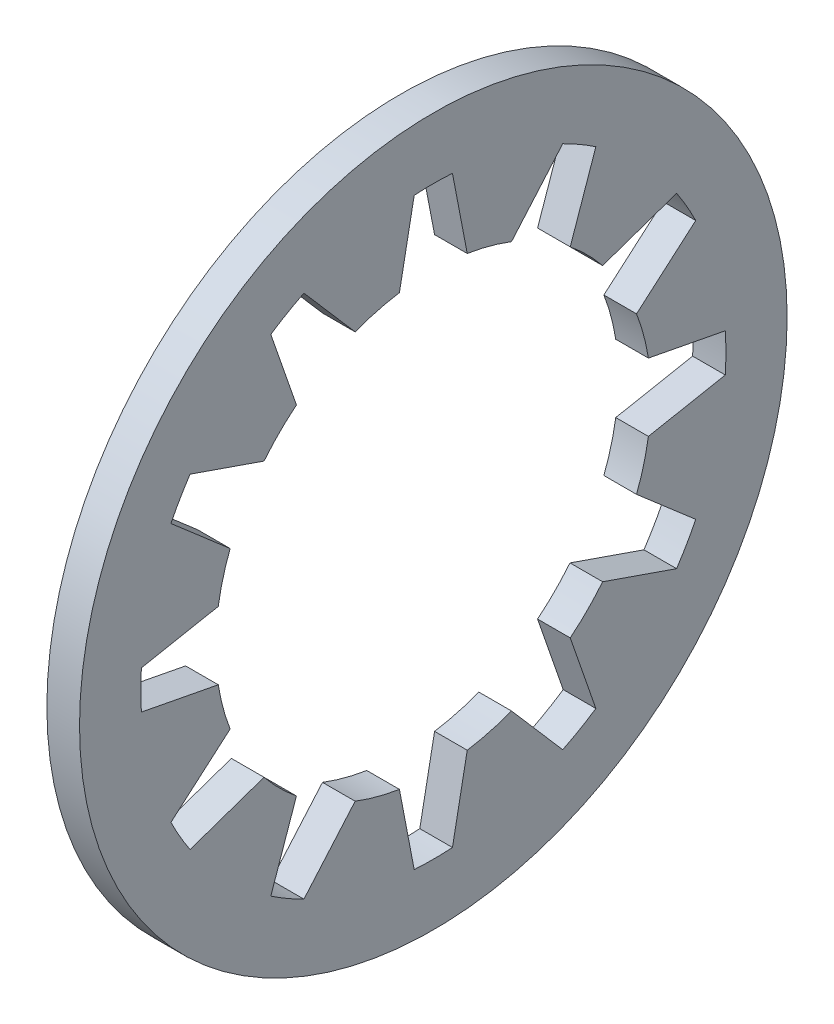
ISO-10303-21;
HEADER;
FILE_DESCRIPTION(('STEP AP214'),'2;1');
FILE_NAME('part.step','',(''),(''),'','','');
FILE_SCHEMA(('AUTOMOTIVE_DESIGN { 1 0 10303 214 1 1 1 1 }'));
ENDSEC;
DATA;
#1=APPLICATION_CONTEXT('core data for automotive mechanical design processes');
#2=APPLICATION_PROTOCOL_DEFINITION('international standard','automotive_design',2000,#1);
#3=PRODUCT_CONTEXT('',#1,'mechanical');
#4=PRODUCT('Part','Part','',(#3));
#5=PRODUCT_RELATED_PRODUCT_CATEGORY('part','',(#4));
#6=PRODUCT_DEFINITION_FORMATION('','',#4);
#7=PRODUCT_DEFINITION_CONTEXT('part definition',#1,'design');
#8=PRODUCT_DEFINITION('design','',#6,#7);
#9=PRODUCT_DEFINITION_SHAPE('','',#8);
#10=(LENGTH_UNIT() NAMED_UNIT(*) SI_UNIT(.MILLI.,.METRE.));
#11=(NAMED_UNIT(*) PLANE_ANGLE_UNIT() SI_UNIT($,.RADIAN.));
#12=(NAMED_UNIT(*) SI_UNIT($,.STERADIAN.) SOLID_ANGLE_UNIT());
#13=UNCERTAINTY_MEASURE_WITH_UNIT(LENGTH_MEASURE(1.E-05),#10,'distance_accuracy_value','');
#14=(GEOMETRIC_REPRESENTATION_CONTEXT(3) GLOBAL_UNCERTAINTY_ASSIGNED_CONTEXT((#13)) GLOBAL_UNIT_ASSIGNED_CONTEXT((#10,
#11,#12)) REPRESENTATION_CONTEXT('',''));
#15=CARTESIAN_POINT('',(0.,0.,0.));
#16=DIRECTION('',(0.,0.,1.));
#17=DIRECTION('',(1.,0.,0.));
#18=AXIS2_PLACEMENT_3D('',#15,#16,#17);
#19=CARTESIAN_POINT('',(-34.9249999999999,0.,0.));
#20=DIRECTION('',(-1.,0.,0.));
#21=DIRECTION('',(0.,0.,1.));
#22=AXIS2_PLACEMENT_3D('',#19,#20,#21);
#23=CYLINDRICAL_SURFACE('',#22,8.);
#24=CARTESIAN_POINT('',(-1.2,0.,0.));
#25=DIRECTION('',(-1.,0.,0.));
#26=DIRECTION('',(0.,0.,1.));
#27=AXIS2_PLACEMENT_3D('',#24,#25,#26);
#28=CIRCLE('',#27,8.);
#29=CARTESIAN_POINT('',(-1.2,1.24575200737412,7.90241114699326));
#30=VERTEX_POINT('',#29);
#31=CARTESIAN_POINT('',(-1.2,2.87235268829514,7.46656480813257));
#32=VERTEX_POINT('',#31);
#33=EDGE_CURVE('E1268',#30,#32,#28,.T.);
#34=ORIENTED_EDGE('',*,*,#33,.T.);
#35=DIRECTION('',(-1.,0.,0.));
#36=VECTOR('',#35,1.);
#37=CARTESIAN_POINT('',(-34.9249999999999,2.87235268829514,7.46656480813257));
#38=LINE('',#37,#36);
#39=CARTESIAN_POINT('',(0.,2.87235268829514,7.46656480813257));
#40=VERTEX_POINT('',#39);
#41=EDGE_CURVE('E597',#32,#40,#38,.F.);
#42=ORIENTED_EDGE('',*,*,#41,.T.);
#43=CARTESIAN_POINT('',(0.,0.,0.));
#44=DIRECTION('',(-1.,0.,0.));
#45=DIRECTION('',(0.,0.,1.));
#46=AXIS2_PLACEMENT_3D('',#43,#44,#45);
#47=CIRCLE('',#46,8.);
#48=CARTESIAN_POINT('',(0.,1.24575200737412,7.90241114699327));
#49=VERTEX_POINT('',#48);
#50=EDGE_CURVE('E705',#49,#40,#47,.T.);
#51=ORIENTED_EDGE('',*,*,#50,.F.);
#52=DIRECTION('',(-1.,0.,0.));
#53=VECTOR('',#52,1.);
#54=CARTESIAN_POINT('',(-34.9249999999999,1.24575200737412,7.90241114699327));
#55=LINE('',#54,#53);
#56=EDGE_CURVE('E61',#49,#30,#55,.T.);
#57=ORIENTED_EDGE('',*,*,#56,.T.);
#58=EDGE_LOOP('',(#34,#42,#51,#57));
#59=FACE_BOUND('',#58,.T.);
#60=ADVANCED_FACE('F39',(#59),#23,.F.);
#61=CARTESIAN_POINT('',(-1.2,-2.87235268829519,7.46656480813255));
#62=VERTEX_POINT('',#61);
#63=CARTESIAN_POINT('',(-1.2,-1.24575200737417,7.90241114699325));
#64=VERTEX_POINT('',#63);
#65=EDGE_CURVE('E757',#62,#64,#28,.T.);
#66=ORIENTED_EDGE('',*,*,#65,.T.);
#67=DIRECTION('',(-1.,0.,0.));
#68=VECTOR('',#67,1.);
#69=CARTESIAN_POINT('',(-34.9249999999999,-1.24575200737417,7.90241114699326));
#70=LINE('',#69,#68);
#71=CARTESIAN_POINT('',(0.,-1.24575200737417,7.90241114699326));
#72=VERTEX_POINT('',#71);
#73=EDGE_CURVE('E595',#64,#72,#70,.F.);
#74=ORIENTED_EDGE('',*,*,#73,.T.);
#75=CARTESIAN_POINT('',(0.,-2.8723526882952,7.46656480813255));
#76=VERTEX_POINT('',#75);
#77=EDGE_CURVE('E710',#76,#72,#47,.T.);
#78=ORIENTED_EDGE('',*,*,#77,.F.);
#79=DIRECTION('',(-1.,0.,0.));
#80=VECTOR('',#79,1.);
#81=CARTESIAN_POINT('',(-34.9249999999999,-2.8723526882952,7.46656480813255));
#82=LINE('',#81,#80);
#83=EDGE_CURVE('E572',#76,#62,#82,.T.);
#84=ORIENTED_EDGE('',*,*,#83,.T.);
#85=EDGE_LOOP('',(#66,#74,#78,#84));
#86=FACE_BOUND('',#85,.T.);
#87=ADVANCED_FACE('F758',(#86),#23,.F.);
#88=CARTESIAN_POINT('',(-1.2,-7.46656480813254,-2.87235268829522));
#89=VERTEX_POINT('',#88);
#90=CARTESIAN_POINT('',(-1.2,-7.90241114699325,-1.2457520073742));
#91=VERTEX_POINT('',#90);
#92=EDGE_CURVE('E869',#89,#91,#28,.T.);
#93=ORIENTED_EDGE('',*,*,#92,.T.);
#94=DIRECTION('',(-1.,0.,0.));
#95=VECTOR('',#94,1.);
#96=CARTESIAN_POINT('',(-34.9249999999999,-7.90241114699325,-1.2457520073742));
#97=LINE('',#96,#95);
#98=CARTESIAN_POINT('',(0.,-7.90241114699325,-1.2457520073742));
#99=VERTEX_POINT('',#98);
#100=EDGE_CURVE('E586',#91,#99,#97,.F.);
#101=ORIENTED_EDGE('',*,*,#100,.T.);
#102=CARTESIAN_POINT('',(0.,-7.46656480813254,-2.87235268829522));
#103=VERTEX_POINT('',#102);
#104=EDGE_CURVE('E730',#103,#99,#47,.T.);
#105=ORIENTED_EDGE('',*,*,#104,.F.);
#106=DIRECTION('',(-1.,0.,0.));
#107=VECTOR('',#106,1.);
#108=CARTESIAN_POINT('',(-34.9249999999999,-7.46656480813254,-2.87235268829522));
#109=LINE('',#108,#107);
#110=EDGE_CURVE('E561',#103,#89,#109,.T.);
#111=ORIENTED_EDGE('',*,*,#110,.T.);
#112=EDGE_LOOP('',(#93,#101,#105,#111));
#113=FACE_BOUND('',#112,.T.);
#114=ADVANCED_FACE('F781',(#113),#23,.F.);
#115=CARTESIAN_POINT('',(0.,-7.90241114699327,1.24575200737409));
#116=VERTEX_POINT('',#115);
#117=CARTESIAN_POINT('',(0.,-7.46656480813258,2.87235268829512));
#118=VERTEX_POINT('',#117);
#119=EDGE_CURVE('E731',#116,#118,#47,.T.);
#120=ORIENTED_EDGE('',*,*,#119,.F.);
#121=DIRECTION('',(-1.,0.,0.));
#122=VECTOR('',#121,1.);
#123=CARTESIAN_POINT('',(-34.9249999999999,-7.90241114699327,1.24575200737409));
#124=LINE('',#123,#122);
#125=CARTESIAN_POINT('',(-1.2,-7.90241114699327,1.24575200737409));
#126=VERTEX_POINT('',#125);
#127=EDGE_CURVE('E584',#116,#126,#124,.T.);
#128=ORIENTED_EDGE('',*,*,#127,.T.);
#129=CARTESIAN_POINT('',(-1.2,-7.46656480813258,2.87235268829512));
#130=VERTEX_POINT('',#129);
#131=EDGE_CURVE('E885',#126,#130,#28,.T.);
#132=ORIENTED_EDGE('',*,*,#131,.T.);
#133=DIRECTION('',(-1.,0.,0.));
#134=VECTOR('',#133,1.);
#135=CARTESIAN_POINT('',(-34.9249999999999,-7.46656480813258,2.87235268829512));
#136=LINE('',#135,#134);
#137=EDGE_CURVE('E585',#130,#118,#136,.F.);
#138=ORIENTED_EDGE('',*,*,#137,.T.);
#139=EDGE_LOOP('',(#120,#128,#132,#138));
#140=FACE_BOUND('',#139,.T.);
#141=ADVANCED_FACE('F879',(#140),#23,.F.);
#142=CARTESIAN_POINT('',(0.,-6.22081280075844,5.03005845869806));
#143=VERTEX_POINT('',#142);
#144=CARTESIAN_POINT('',(0.,-5.03005845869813,6.22081280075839));
#145=VERTEX_POINT('',#144);
#146=EDGE_CURVE('E706',#143,#145,#47,.T.);
#147=ORIENTED_EDGE('',*,*,#146,.F.);
#148=DIRECTION('',(-1.,0.,0.));
#149=VECTOR('',#148,1.);
#150=CARTESIAN_POINT('',(-34.9249999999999,-6.22081280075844,5.03005845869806));
#151=LINE('',#150,#149);
#152=CARTESIAN_POINT('',(-1.2,-6.22081280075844,5.03005845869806));
#153=VERTEX_POINT('',#152);
#154=EDGE_CURVE('E576',#143,#153,#151,.T.);
#155=ORIENTED_EDGE('',*,*,#154,.T.);
#156=CARTESIAN_POINT('',(-1.2,-5.03005845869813,6.22081280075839));
#157=VERTEX_POINT('',#156);
#158=EDGE_CURVE('E748',#153,#157,#28,.T.);
#159=ORIENTED_EDGE('',*,*,#158,.T.);
#160=DIRECTION('',(-1.,0.,0.));
#161=VECTOR('',#160,1.);
#162=CARTESIAN_POINT('',(-34.9249999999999,-5.03005845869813,6.22081280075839));
#163=LINE('',#162,#161);
#164=EDGE_CURVE('E577',#157,#145,#163,.F.);
#165=ORIENTED_EDGE('',*,*,#164,.T.);
#166=EDGE_LOOP('',(#147,#155,#159,#165));
#167=FACE_BOUND('',#166,.T.);
#168=ADVANCED_FACE('F741',(#167),#23,.F.);
#169=CARTESIAN_POINT('',(-1.2,-1.24575200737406,-7.90241114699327));
#170=VERTEX_POINT('',#169);
#171=CARTESIAN_POINT('',(-1.2,-2.87235268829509,-7.46656480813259));
#172=VERTEX_POINT('',#171);
#173=EDGE_CURVE('E844',#170,#172,#28,.T.);
#174=ORIENTED_EDGE('',*,*,#173,.T.);
#175=DIRECTION('',(-1.,0.,0.));
#176=VECTOR('',#175,1.);
#177=CARTESIAN_POINT('',(-34.9249999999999,-2.87235268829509,-7.46656480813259));
#178=LINE('',#177,#176);
#179=CARTESIAN_POINT('',(0.,-2.87235268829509,-7.46656480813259));
#180=VERTEX_POINT('',#179);
#181=EDGE_CURVE('E569',#172,#180,#178,.F.);
#182=ORIENTED_EDGE('',*,*,#181,.T.);
#183=CARTESIAN_POINT('',(0.,-1.24575200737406,-7.90241114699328));
#184=VERTEX_POINT('',#183);
#185=EDGE_CURVE('E717',#184,#180,#47,.T.);
#186=ORIENTED_EDGE('',*,*,#185,.F.);
#187=DIRECTION('',(-1.,0.,0.));
#188=VECTOR('',#187,1.);
#189=CARTESIAN_POINT('',(-34.9249999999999,-1.24575200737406,-7.90241114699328));
#190=LINE('',#189,#188);
#191=EDGE_CURVE('E554',#184,#170,#190,.T.);
#192=ORIENTED_EDGE('',*,*,#191,.T.);
#193=EDGE_LOOP('',(#174,#182,#186,#192));
#194=FACE_BOUND('',#193,.T.);
#195=ADVANCED_FACE('F843',(#194),#23,.F.);
#196=CARTESIAN_POINT('',(0.,-5.03005845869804,-6.22081280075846));
#197=VERTEX_POINT('',#196);
#198=CARTESIAN_POINT('',(0.,-6.22081280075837,-5.03005845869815));
#199=VERTEX_POINT('',#198);
#200=EDGE_CURVE('E721',#197,#199,#47,.T.);
#201=ORIENTED_EDGE('',*,*,#200,.F.);
#202=DIRECTION('',(-1.,0.,0.));
#203=VECTOR('',#202,1.);
#204=CARTESIAN_POINT('',(-34.9249999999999,-5.03005845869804,-6.22081280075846));
#205=LINE('',#204,#203);
#206=CARTESIAN_POINT('',(-1.2,-5.03005845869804,-6.22081280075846));
#207=VERTEX_POINT('',#206);
#208=EDGE_CURVE('E570',#197,#207,#205,.T.);
#209=ORIENTED_EDGE('',*,*,#208,.T.);
#210=CARTESIAN_POINT('',(-1.2,-6.22081280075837,-5.03005845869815));
#211=VERTEX_POINT('',#210);
#212=EDGE_CURVE('E856',#207,#211,#28,.T.);
#213=ORIENTED_EDGE('',*,*,#212,.T.);
#214=DIRECTION('',(-1.,0.,0.));
#215=VECTOR('',#214,1.);
#216=CARTESIAN_POINT('',(-34.9249999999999,-6.22081280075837,-5.03005845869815));
#217=LINE('',#216,#215);
#218=EDGE_CURVE('E562',#211,#199,#217,.F.);
#219=ORIENTED_EDGE('',*,*,#218,.T.);
#220=EDGE_LOOP('',(#201,#209,#213,#219));
#221=FACE_BOUND('',#220,.T.);
#222=ADVANCED_FACE('F857',(#221),#23,.F.);
#223=CARTESIAN_POINT('',(-1.2,2.87235268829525,-7.46656480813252));
#224=VERTEX_POINT('',#223);
#225=CARTESIAN_POINT('',(-1.2,1.24575200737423,-7.90241114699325));
#226=VERTEX_POINT('',#225);
#227=EDGE_CURVE('E835',#224,#226,#28,.T.);
#228=ORIENTED_EDGE('',*,*,#227,.T.);
#229=DIRECTION('',(-1.,0.,0.));
#230=VECTOR('',#229,1.);
#231=CARTESIAN_POINT('',(-34.9249999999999,1.24575200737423,-7.90241114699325));
#232=LINE('',#231,#230);
#233=CARTESIAN_POINT('',(0.,1.24575200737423,-7.90241114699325));
#234=VERTEX_POINT('',#233);
#235=EDGE_CURVE('E556',#226,#234,#232,.F.);
#236=ORIENTED_EDGE('',*,*,#235,.T.);
#237=CARTESIAN_POINT('',(0.,2.87235268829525,-7.46656480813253));
#238=VERTEX_POINT('',#237);
#239=EDGE_CURVE('E714',#238,#234,#47,.T.);
#240=ORIENTED_EDGE('',*,*,#239,.F.);
#241=DIRECTION('',(-1.,0.,0.));
#242=VECTOR('',#241,1.);
#243=CARTESIAN_POINT('',(-34.9249999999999,2.87235268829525,-7.46656480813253));
#244=LINE('',#243,#242);
#245=EDGE_CURVE('E375',#238,#224,#244,.T.);
#246=ORIENTED_EDGE('',*,*,#245,.T.);
#247=EDGE_LOOP('',(#228,#236,#240,#246));
#248=FACE_BOUND('',#247,.T.);
#249=ADVANCED_FACE('F831',(#248),#23,.F.);
#250=CARTESIAN_POINT('',(-1.2,7.90241114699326,-1.24575200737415));
#251=VERTEX_POINT('',#250);
#252=CARTESIAN_POINT('',(-1.2,7.46656480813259,-2.87235268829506));
#253=VERTEX_POINT('',#252);
#254=EDGE_CURVE('E661',#251,#253,#28,.T.);
#255=ORIENTED_EDGE('',*,*,#254,.T.);
#256=DIRECTION('',(-1.,0.,0.));
#257=VECTOR('',#256,1.);
#258=CARTESIAN_POINT('',(-34.9249999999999,7.4665648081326,-2.87235268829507));
#259=LINE('',#258,#257);
#260=CARTESIAN_POINT('',(0.,7.4665648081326,-2.87235268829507));
#261=VERTEX_POINT('',#260);
#262=EDGE_CURVE('E552',#253,#261,#259,.F.);
#263=ORIENTED_EDGE('',*,*,#262,.T.);
#264=CARTESIAN_POINT('',(0.,7.90241114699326,-1.24575200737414));
#265=VERTEX_POINT('',#264);
#266=EDGE_CURVE('E653',#265,#261,#47,.T.);
#267=ORIENTED_EDGE('',*,*,#266,.F.);
#268=DIRECTION('',(-1.,0.,0.));
#269=VECTOR('',#268,1.);
#270=CARTESIAN_POINT('',(-34.9249999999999,7.90241114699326,-1.24575200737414));
#271=LINE('',#270,#269);
#272=EDGE_CURVE('E645',#265,#251,#271,.T.);
#273=ORIENTED_EDGE('',*,*,#272,.T.);
#274=EDGE_LOOP('',(#255,#263,#267,#273));
#275=FACE_BOUND('',#274,.T.);
#276=ADVANCED_FACE('F806',(#275),#23,.F.);
#277=CARTESIAN_POINT('',(0.,6.22081280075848,-5.03005845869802));
#278=VERTEX_POINT('',#277);
#279=CARTESIAN_POINT('',(0.,5.03005845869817,-6.22081280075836));
#280=VERTEX_POINT('',#279);
#281=EDGE_CURVE('E654',#278,#280,#47,.T.);
#282=ORIENTED_EDGE('',*,*,#281,.F.);
#283=DIRECTION('',(-1.,0.,0.));
#284=VECTOR('',#283,1.);
#285=CARTESIAN_POINT('',(-34.9249999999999,6.22081280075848,-5.03005845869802));
#286=LINE('',#285,#284);
#287=CARTESIAN_POINT('',(-1.2,6.22081280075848,-5.03005845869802));
#288=VERTEX_POINT('',#287);
#289=EDGE_CURVE('E547',#278,#288,#286,.T.);
#290=ORIENTED_EDGE('',*,*,#289,.T.);
#291=CARTESIAN_POINT('',(-1.2,5.03005845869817,-6.22081280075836));
#292=VERTEX_POINT('',#291);
#293=EDGE_CURVE('E670',#288,#292,#28,.T.);
#294=ORIENTED_EDGE('',*,*,#293,.T.);
#295=DIRECTION('',(-1.,0.,0.));
#296=VECTOR('',#295,1.);
#297=CARTESIAN_POINT('',(-34.9249999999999,5.03005845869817,-6.22081280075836));
#298=LINE('',#297,#296);
#299=EDGE_CURVE('E548',#292,#280,#298,.F.);
#300=ORIENTED_EDGE('',*,*,#299,.T.);
#301=EDGE_LOOP('',(#282,#290,#294,#300));
#302=FACE_BOUND('',#301,.T.);
#303=ADVANCED_FACE('F795',(#302),#23,.F.);
#304=CARTESIAN_POINT('',(0.,5.03005845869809,6.22081280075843));
#305=VERTEX_POINT('',#304);
#306=CARTESIAN_POINT('',(0.,6.22081280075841,5.03005845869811));
#307=VERTEX_POINT('',#306);
#308=EDGE_CURVE('E658',#305,#307,#47,.T.);
#309=ORIENTED_EDGE('',*,*,#308,.F.);
#310=DIRECTION('',(-1.,0.,0.));
#311=VECTOR('',#310,1.);
#312=CARTESIAN_POINT('',(-34.9249999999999,5.03005845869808,6.22081280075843));
#313=LINE('',#312,#311);
#314=CARTESIAN_POINT('',(-1.2,5.03005845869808,6.22081280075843));
#315=VERTEX_POINT('',#314);
#316=EDGE_CURVE('E53',#305,#315,#313,.T.);
#317=ORIENTED_EDGE('',*,*,#316,.T.);
#318=CARTESIAN_POINT('',(-1.2,6.22081280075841,5.0300584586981));
#319=VERTEX_POINT('',#318);
#320=EDGE_CURVE('E361',#315,#319,#28,.T.);
#321=ORIENTED_EDGE('',*,*,#320,.T.);
#322=DIRECTION('',(-1.,0.,0.));
#323=VECTOR('',#322,1.);
#324=CARTESIAN_POINT('',(-34.9249999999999,6.22081280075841,5.03005845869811));
#325=LINE('',#324,#323);
#326=EDGE_CURVE('E623',#319,#307,#325,.F.);
#327=ORIENTED_EDGE('',*,*,#326,.T.);
#328=EDGE_LOOP('',(#309,#317,#321,#327));
#329=FACE_BOUND('',#328,.T.);
#330=ADVANCED_FACE('F784',(#329),#23,.F.);
#331=CARTESIAN_POINT('',(0.,7.46656480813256,2.87235268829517));
#332=VERTEX_POINT('',#331);
#333=CARTESIAN_POINT('',(0.,7.90241114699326,1.24575200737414));
#334=VERTEX_POINT('',#333);
#335=EDGE_CURVE('E649',#332,#334,#47,.T.);
#336=ORIENTED_EDGE('',*,*,#335,.F.);
#337=DIRECTION('',(-1.,0.,0.));
#338=VECTOR('',#337,1.);
#339=CARTESIAN_POINT('',(-34.9249999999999,7.46656480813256,2.87235268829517));
#340=LINE('',#339,#338);
#341=CARTESIAN_POINT('',(-1.2,7.46656480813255,2.87235268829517));
#342=VERTEX_POINT('',#341);
#343=EDGE_CURVE('E618',#332,#342,#340,.T.);
#344=ORIENTED_EDGE('',*,*,#343,.T.);
#345=CARTESIAN_POINT('',(-1.2,7.90241114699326,1.24575200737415));
#346=VERTEX_POINT('',#345);
#347=EDGE_CURVE('E665',#342,#346,#28,.T.);
#348=ORIENTED_EDGE('',*,*,#347,.T.);
#349=DIRECTION('',(-1.,0.,0.));
#350=VECTOR('',#349,1.);
#351=CARTESIAN_POINT('',(-34.9249999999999,7.90241114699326,1.24575200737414));
#352=LINE('',#351,#350);
#353=EDGE_CURVE('E650',#346,#334,#352,.F.);
#354=ORIENTED_EDGE('',*,*,#353,.T.);
#355=EDGE_LOOP('',(#336,#344,#348,#354));
#356=FACE_BOUND('',#355,.T.);
#357=ADVANCED_FACE('F41',(#356),#23,.F.);
#358=CARTESIAN_POINT('',(-1.2,13.,0.));
#359=DIRECTION('',(1.,0.,0.));
#360=DIRECTION('',(0.,0.,-1.));
#361=AXIS2_PLACEMENT_3D('',#358,#359,#360);
#362=PLANE('',#361);
#363=CARTESIAN_POINT('',(-1.2,0.,0.));
#364=DIRECTION('',(1.,0.,0.));
#365=DIRECTION('',(0.,0.86602540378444,-0.499999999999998));
#366=AXIS2_PLACEMENT_3D('',#363,#364,#365);
#367=CIRCLE('',#366,10.75);
#368=CARTESIAN_POINT('',(-1.2,5.97238000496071,8.93829833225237));
#369=VERTEX_POINT('',#368);
#370=CARTESIAN_POINT('',(-1.2,4.75460341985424,9.64138197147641));
#371=VERTEX_POINT('',#370);
#372=EDGE_CURVE('E351',#369,#371,#367,.T.);
#373=ORIENTED_EDGE('',*,*,#372,.T.);
#374=DIRECTION('',(0.,-0.654415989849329,-0.756134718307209));
#375=VECTOR('',#374,1.);
#376=CARTESIAN_POINT('',(-1.2,4.75460341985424,9.64138197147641));
#377=LINE('',#376,#375);
#378=EDGE_CURVE('E349',#371,#32,#377,.T.);
#379=ORIENTED_EDGE('',*,*,#378,.T.);
#380=ORIENTED_EDGE('',*,*,#33,.F.);
#381=DIRECTION('',(0.,-0.18867351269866,0.982039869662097));
#382=VECTOR('',#381,1.);
#383=CARTESIAN_POINT('',(-1.2,0.703083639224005,10.726983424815));
#384=LINE('',#383,#382);
#385=CARTESIAN_POINT('',(-1.2,0.703083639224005,10.726983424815));
#386=VERTEX_POINT('',#385);
#387=EDGE_CURVE('E372',#30,#386,#384,.T.);
#388=ORIENTED_EDGE('',*,*,#387,.T.);
#389=CARTESIAN_POINT('',(-1.2,0.,0.));
#390=DIRECTION('',(1.,0.,0.));
#391=DIRECTION('',(0.,1.,0.));
#392=AXIS2_PLACEMENT_3D('',#389,#390,#391);
#393=CIRCLE('',#392,10.75);
#394=CARTESIAN_POINT('',(-1.2,-0.70308363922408,10.726983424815));
#395=VERTEX_POINT('',#394);
#396=EDGE_CURVE('E380',#386,#395,#393,.T.);
#397=ORIENTED_EDGE('',*,*,#396,.T.);
#398=DIRECTION('',(0.,-0.188673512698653,-0.982039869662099));
#399=VECTOR('',#398,1.);
#400=CARTESIAN_POINT('',(-1.2,-0.70308363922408,10.726983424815));
#401=LINE('',#400,#399);
#402=EDGE_CURVE('E382',#395,#64,#401,.T.);
#403=ORIENTED_EDGE('',*,*,#402,.T.);
#404=ORIENTED_EDGE('',*,*,#65,.F.);
#405=DIRECTION('',(0.,-0.654415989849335,0.756134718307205));
#406=VECTOR('',#405,1.);
#407=CARTESIAN_POINT('',(-1.2,-4.75460341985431,9.64138197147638));
#408=LINE('',#407,#406);
#409=CARTESIAN_POINT('',(-1.2,-4.75460341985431,9.64138197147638));
#410=VERTEX_POINT('',#409);
#411=EDGE_CURVE('E433',#62,#410,#408,.T.);
#412=ORIENTED_EDGE('',*,*,#411,.T.);
#413=CARTESIAN_POINT('',(-1.2,0.,0.));
#414=DIRECTION('',(1.,0.,0.));
#415=DIRECTION('',(0.,0.866025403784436,0.500000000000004));
#416=AXIS2_PLACEMENT_3D('',#413,#414,#415);
#417=CIRCLE('',#416,10.75);
#418=CARTESIAN_POINT('',(-1.2,-5.97238000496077,8.93829833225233));
#419=VERTEX_POINT('',#418);
#420=EDGE_CURVE('E436',#410,#419,#417,.T.);
#421=ORIENTED_EDGE('',*,*,#420,.T.);
#422=DIRECTION('',(0.,0.327623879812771,-0.944808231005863));
#423=VECTOR('',#422,1.);
#424=CARTESIAN_POINT('',(-1.2,-5.97238000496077,8.93829833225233));
#425=LINE('',#424,#423);
#426=EDGE_CURVE('E439',#419,#157,#425,.T.);
#427=ORIENTED_EDGE('',*,*,#426,.T.);
#428=ORIENTED_EDGE('',*,*,#158,.F.);
#429=DIRECTION('',(0.,-0.944808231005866,0.327623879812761));
#430=VECTOR('',#429,1.);
#431=CARTESIAN_POINT('',(-1.2,-8.93829833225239,5.97238000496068));
#432=LINE('',#431,#430);
#433=CARTESIAN_POINT('',(-1.2,-8.93829833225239,5.97238000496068));
#434=VERTEX_POINT('',#433);
#435=EDGE_CURVE('E391',#153,#434,#432,.T.);
#436=ORIENTED_EDGE('',*,*,#435,.T.);
#437=CARTESIAN_POINT('',(-1.2,0.,0.));
#438=DIRECTION('',(1.,0.,0.));
#439=DIRECTION('',(0.,0.499999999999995,0.866025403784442));
#440=AXIS2_PLACEMENT_3D('',#437,#438,#439);
#441=CIRCLE('',#440,10.75);
#442=CARTESIAN_POINT('',(-1.2,-9.64138197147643,4.7546034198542));
#443=VERTEX_POINT('',#442);
#444=EDGE_CURVE('E398',#434,#443,#441,.T.);
#445=ORIENTED_EDGE('',*,*,#444,.T.);
#446=DIRECTION('',(0.,0.756134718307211,-0.654415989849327));
#447=VECTOR('',#446,1.);
#448=CARTESIAN_POINT('',(-1.2,-9.64138197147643,4.7546034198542));
#449=LINE('',#448,#447);
#450=EDGE_CURVE('E399',#443,#130,#449,.T.);
#451=ORIENTED_EDGE('',*,*,#450,.T.);
#452=ORIENTED_EDGE('',*,*,#131,.F.);
#453=DIRECTION('',(0.,-0.982039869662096,-0.188673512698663));
#454=VECTOR('',#453,1.);
#455=CARTESIAN_POINT('',(-1.2,-10.726983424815,0.703083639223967));
#456=LINE('',#455,#454);
#457=CARTESIAN_POINT('',(-1.2,-10.726983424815,0.703083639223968));
#458=VERTEX_POINT('',#457);
#459=EDGE_CURVE('E412',#126,#458,#456,.T.);
#460=ORIENTED_EDGE('',*,*,#459,.T.);
#461=CARTESIAN_POINT('',(-1.2,0.,0.));
#462=DIRECTION('',(1.,0.,0.));
#463=DIRECTION('',(0.,0.,1.));
#464=AXIS2_PLACEMENT_3D('',#461,#462,#463);
#465=CIRCLE('',#464,10.75);
#466=CARTESIAN_POINT('',(-1.2,-10.726983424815,-0.703083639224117));
#467=VERTEX_POINT('',#466);
#468=EDGE_CURVE('E420',#458,#467,#465,.T.);
#469=ORIENTED_EDGE('',*,*,#468,.T.);
#470=DIRECTION('',(0.,0.982039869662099,-0.188673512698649));
#471=VECTOR('',#470,1.);
#472=CARTESIAN_POINT('',(-1.2,-10.726983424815,-0.703083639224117));
#473=LINE('',#472,#471);
#474=EDGE_CURVE('E423',#467,#91,#473,.T.);
#475=ORIENTED_EDGE('',*,*,#474,.T.);
#476=ORIENTED_EDGE('',*,*,#92,.F.);
#477=DIRECTION('',(0.,-0.756134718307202,-0.654415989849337));
#478=VECTOR('',#477,1.);
#479=CARTESIAN_POINT('',(-1.2,-9.64138197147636,-4.75460341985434));
#480=LINE('',#479,#478);
#481=CARTESIAN_POINT('',(-1.2,-9.64138197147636,-4.75460341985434));
#482=VERTEX_POINT('',#481);
#483=EDGE_CURVE('E471',#89,#482,#480,.T.);
#484=ORIENTED_EDGE('',*,*,#483,.T.);
#485=CARTESIAN_POINT('',(-1.2,0.,0.));
#486=DIRECTION('',(1.,0.,0.));
#487=DIRECTION('',(0.,-0.500000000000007,0.866025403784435));
#488=AXIS2_PLACEMENT_3D('',#485,#486,#487);
#489=CIRCLE('',#488,10.75);
#490=CARTESIAN_POINT('',(-1.2,-8.93829833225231,-5.9723800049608));
#491=VERTEX_POINT('',#490);
#492=EDGE_CURVE('E473',#482,#491,#489,.T.);
#493=ORIENTED_EDGE('',*,*,#492,.T.);
#494=DIRECTION('',(0.,0.944808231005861,0.327623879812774));
#495=VECTOR('',#494,1.);
#496=CARTESIAN_POINT('',(-1.2,-8.93829833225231,-5.9723800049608));
#497=LINE('',#496,#495);
#498=EDGE_CURVE('E476',#491,#211,#497,.T.);
#499=ORIENTED_EDGE('',*,*,#498,.T.);
#500=ORIENTED_EDGE('',*,*,#212,.F.);
#501=DIRECTION('',(0.,-0.327623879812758,-0.944808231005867));
#502=VECTOR('',#501,1.);
#503=CARTESIAN_POINT('',(-1.2,-5.97238000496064,-8.93829833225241));
#504=LINE('',#503,#502);
#505=CARTESIAN_POINT('',(-1.2,-5.97238000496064,-8.93829833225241));
#506=VERTEX_POINT('',#505);
#507=EDGE_CURVE('E448',#207,#506,#504,.T.);
#508=ORIENTED_EDGE('',*,*,#507,.T.);
#509=CARTESIAN_POINT('',(-1.2,0.,0.));
#510=DIRECTION('',(1.,0.,0.));
#511=DIRECTION('',(0.,-0.866025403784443,0.499999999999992));
#512=AXIS2_PLACEMENT_3D('',#509,#510,#511);
#513=CIRCLE('',#512,10.75);
#514=CARTESIAN_POINT('',(-1.2,-4.75460341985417,-9.64138197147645));
#515=VERTEX_POINT('',#514);
#516=EDGE_CURVE('E452',#506,#515,#513,.T.);
#517=ORIENTED_EDGE('',*,*,#516,.T.);
#518=DIRECTION('',(0.,0.654415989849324,0.756134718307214));
#519=VECTOR('',#518,1.);
#520=CARTESIAN_POINT('',(-1.2,-4.75460341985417,-9.64138197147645));
#521=LINE('',#520,#519);
#522=EDGE_CURVE('E460',#515,#172,#521,.T.);
#523=ORIENTED_EDGE('',*,*,#522,.T.);
#524=ORIENTED_EDGE('',*,*,#173,.F.);
#525=DIRECTION('',(0.,0.188673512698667,-0.982039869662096));
#526=VECTOR('',#525,1.);
#527=CARTESIAN_POINT('',(-1.2,-0.70308363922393,-10.726983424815));
#528=LINE('',#527,#526);
#529=CARTESIAN_POINT('',(-1.2,-0.70308363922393,-10.726983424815));
#530=VERTEX_POINT('',#529);
#531=EDGE_CURVE('E486',#170,#530,#528,.T.);
#532=ORIENTED_EDGE('',*,*,#531,.T.);
#533=CARTESIAN_POINT('',(-1.2,0.,0.));
#534=DIRECTION('',(1.,0.,0.));
#535=DIRECTION('',(0.,-1.,0.));
#536=AXIS2_PLACEMENT_3D('',#533,#534,#535);
#537=CIRCLE('',#536,10.75);
#538=CARTESIAN_POINT('',(-1.2,0.703083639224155,-10.726983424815));
#539=VERTEX_POINT('',#538);
#540=EDGE_CURVE('E493',#530,#539,#537,.T.);
#541=ORIENTED_EDGE('',*,*,#540,.T.);
#542=DIRECTION('',(0.,0.188673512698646,0.9820398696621));
#543=VECTOR('',#542,1.);
#544=CARTESIAN_POINT('',(-1.2,0.703083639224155,-10.726983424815));
#545=LINE('',#544,#543);
#546=EDGE_CURVE('E492',#539,#226,#545,.T.);
#547=ORIENTED_EDGE('',*,*,#546,.T.);
#548=ORIENTED_EDGE('',*,*,#227,.F.);
#549=DIRECTION('',(0.,0.65441598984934,-0.7561347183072));
#550=VECTOR('',#549,1.);
#551=CARTESIAN_POINT('',(-1.2,4.75460341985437,-9.64138197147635));
#552=LINE('',#551,#550);
#553=CARTESIAN_POINT('',(-1.2,4.75460341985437,-9.64138197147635));
#554=VERTEX_POINT('',#553);
#555=EDGE_CURVE('E530',#224,#554,#552,.T.);
#556=ORIENTED_EDGE('',*,*,#555,.T.);
#557=CARTESIAN_POINT('',(-1.2,0.,0.));
#558=DIRECTION('',(1.,0.,0.));
#559=DIRECTION('',(0.,-0.866025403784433,-0.50000000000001));
#560=AXIS2_PLACEMENT_3D('',#557,#558,#559);
#561=CIRCLE('',#560,10.75);
#562=CARTESIAN_POINT('',(-1.2,5.97238000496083,-8.93829833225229));
#563=VERTEX_POINT('',#562);
#564=EDGE_CURVE('E529',#554,#563,#561,.T.);
#565=ORIENTED_EDGE('',*,*,#564,.T.);
#566=DIRECTION('',(0.,-0.327623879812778,0.94480823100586));
#567=VECTOR('',#566,1.);
#568=CARTESIAN_POINT('',(-1.2,5.97238000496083,-8.93829833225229));
#569=LINE('',#568,#567);
#570=EDGE_CURVE('E534',#563,#292,#569,.T.);
#571=ORIENTED_EDGE('',*,*,#570,.T.);
#572=ORIENTED_EDGE('',*,*,#293,.F.);
#573=DIRECTION('',(0.,0.944808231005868,-0.327623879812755));
#574=VECTOR('',#573,1.);
#575=CARTESIAN_POINT('',(-1.2,8.93829833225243,-5.97238000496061));
#576=LINE('',#575,#574);
#577=CARTESIAN_POINT('',(-1.2,8.93829833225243,-5.97238000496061));
#578=VERTEX_POINT('',#577);
#579=EDGE_CURVE('E510',#288,#578,#576,.T.);
#580=ORIENTED_EDGE('',*,*,#579,.T.);
#581=CARTESIAN_POINT('',(-1.2,0.,0.));
#582=DIRECTION('',(1.,0.,0.));
#583=DIRECTION('',(0.,-0.499999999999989,-0.866025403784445));
#584=AXIS2_PLACEMENT_3D('',#581,#582,#583);
#585=CIRCLE('',#584,10.75);
#586=CARTESIAN_POINT('',(-1.2,9.64138197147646,-4.75460341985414));
#587=VERTEX_POINT('',#586);
#588=EDGE_CURVE('E509',#578,#587,#585,.T.);
#589=ORIENTED_EDGE('',*,*,#588,.T.);
#590=DIRECTION('',(0.,-0.756134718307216,0.654415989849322));
#591=VECTOR('',#590,1.);
#592=CARTESIAN_POINT('',(-1.2,9.64138197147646,-4.75460341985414));
#593=LINE('',#592,#591);
#594=EDGE_CURVE('E511',#587,#253,#593,.T.);
#595=ORIENTED_EDGE('',*,*,#594,.T.);
#596=ORIENTED_EDGE('',*,*,#254,.F.);
#597=DIRECTION('',(0.,0.982039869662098,0.188673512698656));
#598=VECTOR('',#597,1.);
#599=CARTESIAN_POINT('',(-1.2,10.726983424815,-0.703083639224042));
#600=LINE('',#599,#598);
#601=CARTESIAN_POINT('',(-1.2,10.726983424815,-0.703083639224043));
#602=VERTEX_POINT('',#601);
#603=EDGE_CURVE('E622',#251,#602,#600,.T.);
#604=ORIENTED_EDGE('',*,*,#603,.T.);
#605=CARTESIAN_POINT('',(-1.2,0.,0.));
#606=DIRECTION('',(1.,0.,0.));
#607=DIRECTION('',(0.,0.,-1.));
#608=AXIS2_PLACEMENT_3D('',#605,#606,#607);
#609=CIRCLE('',#608,10.75);
#610=CARTESIAN_POINT('',(-1.2,10.726983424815,0.703083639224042));
#611=VERTEX_POINT('',#610);
#612=EDGE_CURVE('E628',#602,#611,#609,.T.);
#613=ORIENTED_EDGE('',*,*,#612,.T.);
#614=DIRECTION('',(0.,-0.982039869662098,0.188673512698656));
#615=VECTOR('',#614,1.);
#616=CARTESIAN_POINT('',(-1.2,10.726983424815,0.703083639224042));
#617=LINE('',#616,#615);
#618=EDGE_CURVE('E635',#611,#346,#617,.T.);
#619=ORIENTED_EDGE('',*,*,#618,.T.);
#620=ORIENTED_EDGE('',*,*,#347,.F.);
#621=DIRECTION('',(0.,0.756134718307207,0.654415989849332));
#622=VECTOR('',#621,1.);
#623=CARTESIAN_POINT('',(-1.2,9.6413819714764,4.75460341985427));
#624=LINE('',#623,#622);
#625=CARTESIAN_POINT('',(-1.2,9.6413819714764,4.75460341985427));
#626=VERTEX_POINT('',#625);
#627=EDGE_CURVE('E598',#342,#626,#624,.T.);
#628=ORIENTED_EDGE('',*,*,#627,.T.);
#629=CARTESIAN_POINT('',(-1.2,0.,0.));
#630=DIRECTION('',(1.,0.,0.));
#631=DIRECTION('',(0.,0.500000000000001,-0.866025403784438));
#632=AXIS2_PLACEMENT_3D('',#629,#630,#631);
#633=CIRCLE('',#632,10.75);
#634=CARTESIAN_POINT('',(-1.2,8.93829833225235,5.97238000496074));
#635=VERTEX_POINT('',#634);
#636=EDGE_CURVE('E602',#626,#635,#633,.T.);
#637=ORIENTED_EDGE('',*,*,#636,.T.);
#638=DIRECTION('',(0.,-0.944808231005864,-0.327623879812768));
#639=VECTOR('',#638,1.);
#640=CARTESIAN_POINT('',(-1.2,8.93829833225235,5.97238000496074));
#641=LINE('',#640,#639);
#642=EDGE_CURVE('E610',#635,#319,#641,.T.);
#643=ORIENTED_EDGE('',*,*,#642,.T.);
#644=ORIENTED_EDGE('',*,*,#320,.F.);
#645=DIRECTION('',(0.,0.327623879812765,0.944808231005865));
#646=VECTOR('',#645,1.);
#647=CARTESIAN_POINT('',(-1.2,5.97238000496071,8.93829833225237));
#648=LINE('',#647,#646);
#649=EDGE_CURVE('E344',#315,#369,#648,.T.);
#650=ORIENTED_EDGE('',*,*,#649,.T.);
#651=EDGE_LOOP('',(#373,#379,#380,#388,#397,#403,#404,#412,#421,#427,#428,#436,#445,#451,#452,
#460,#469,#475,#476,#484,#493,#499,#500,#508,#517,#523,#524,#532,#541,#547,#548,#556,#565,#571,
#572,#580,#589,#595,#596,#604,#613,#619,#620,#628,#637,#643,#644,#650));
#652=FACE_BOUND('',#651,.T.);
#653=CARTESIAN_POINT('',(-1.2,0.,0.));
#654=DIRECTION('',(-1.,0.,0.));
#655=DIRECTION('',(0.,0.,1.));
#656=AXIS2_PLACEMENT_3D('',#653,#654,#655);
#657=CIRCLE('',#656,13.);
#658=CARTESIAN_POINT('',(-1.2,0.,13.));
#659=VERTEX_POINT('',#658);
#660=EDGE_CURVE('E657',#659,#659,#657,.T.);
#661=ORIENTED_EDGE('',*,*,#660,.T.);
#662=EDGE_LOOP('',(#661));
#663=FACE_BOUND('',#662,.T.);
#664=ADVANCED_FACE('F359',(#652,#663),#362,.F.);
#665=CARTESIAN_POINT('',(-34.9249999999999,0.,0.));
#666=DIRECTION('',(-1.,0.,0.));
#667=DIRECTION('',(0.,0.,1.));
#668=AXIS2_PLACEMENT_3D('',#665,#666,#667);
#669=CYLINDRICAL_SURFACE('',#668,13.);
#670=ORIENTED_EDGE('',*,*,#660,.F.);
#671=EDGE_LOOP('',(#670));
#672=FACE_BOUND('',#671,.T.);
#673=CARTESIAN_POINT('',(0.,0.,0.));
#674=DIRECTION('',(-1.,0.,0.));
#675=DIRECTION('',(0.,0.,1.));
#676=AXIS2_PLACEMENT_3D('',#673,#674,#675);
#677=CIRCLE('',#676,13.);
#678=CARTESIAN_POINT('',(0.,0.,13.));
#679=VERTEX_POINT('',#678);
#680=EDGE_CURVE('E652',#679,#679,#677,.T.);
#681=ORIENTED_EDGE('',*,*,#680,.T.);
#682=EDGE_LOOP('',(#681));
#683=FACE_BOUND('',#682,.T.);
#684=ADVANCED_FACE('F792',(#672,#683),#669,.T.);
#685=CARTESIAN_POINT('',(0.,8.,0.));
#686=DIRECTION('',(-1.,0.,0.));
#687=DIRECTION('',(0.,0.,1.));
#688=AXIS2_PLACEMENT_3D('',#685,#686,#687);
#689=PLANE('',#688);
#690=ORIENTED_EDGE('',*,*,#680,.F.);
#691=EDGE_LOOP('',(#690));
#692=FACE_BOUND('',#691,.T.);
#693=ORIENTED_EDGE('',*,*,#50,.T.);
#694=DIRECTION('',(0.,-0.654415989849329,-0.756134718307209));
#695=VECTOR('',#694,1.);
#696=CARTESIAN_POINT('',(0.,4.75460341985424,9.64138197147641));
#697=LINE('',#696,#695);
#698=CARTESIAN_POINT('',(0.,4.75460341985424,9.64138197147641));
#699=VERTEX_POINT('',#698);
#700=EDGE_CURVE('E364',#699,#40,#697,.T.);
#701=ORIENTED_EDGE('',*,*,#700,.F.);
#702=CARTESIAN_POINT('',(0.,0.,0.));
#703=DIRECTION('',(1.,0.,0.));
#704=DIRECTION('',(0.,0.86602540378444,-0.499999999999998));
#705=AXIS2_PLACEMENT_3D('',#702,#703,#704);
#706=CIRCLE('',#705,10.75);
#707=CARTESIAN_POINT('',(0.,5.97238000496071,8.93829833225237));
#708=VERTEX_POINT('',#707);
#709=EDGE_CURVE('E366',#708,#699,#706,.T.);
#710=ORIENTED_EDGE('',*,*,#709,.F.);
#711=DIRECTION('',(0.,-0.327623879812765,-0.944808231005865));
#712=VECTOR('',#711,1.);
#713=CARTESIAN_POINT('',(0.,3.42324307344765,1.58704678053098));
#714=LINE('',#713,#712);
#715=EDGE_CURVE('E11',#708,#305,#714,.T.);
#716=ORIENTED_EDGE('',*,*,#715,.T.);
#717=ORIENTED_EDGE('',*,*,#308,.T.);
#718=DIRECTION('',(0.,-0.944808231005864,-0.327623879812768));
#719=VECTOR('',#718,1.);
#720=CARTESIAN_POINT('',(0.,8.93829833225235,5.97238000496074));
#721=LINE('',#720,#719);
#722=CARTESIAN_POINT('',(0.,8.93829833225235,5.97238000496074));
#723=VERTEX_POINT('',#722);
#724=EDGE_CURVE('E603',#723,#307,#721,.T.);
#725=ORIENTED_EDGE('',*,*,#724,.F.);
#726=CARTESIAN_POINT('',(0.,0.,0.));
#727=DIRECTION('',(1.,0.,0.));
#728=DIRECTION('',(0.,0.500000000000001,-0.866025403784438));
#729=AXIS2_PLACEMENT_3D('',#726,#727,#728);
#730=CIRCLE('',#729,10.75);
#731=CARTESIAN_POINT('',(0.,9.6413819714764,4.75460341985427));
#732=VERTEX_POINT('',#731);
#733=EDGE_CURVE('E599',#732,#723,#730,.T.);
#734=ORIENTED_EDGE('',*,*,#733,.F.);
#735=DIRECTION('',(0.,-0.756134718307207,-0.654415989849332));
#736=VECTOR('',#735,1.);
#737=CARTESIAN_POINT('',(0.,6.35023423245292,1.90619604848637));
#738=LINE('',#737,#736);
#739=EDGE_CURVE('E669',#732,#332,#738,.T.);
#740=ORIENTED_EDGE('',*,*,#739,.T.);
#741=ORIENTED_EDGE('',*,*,#335,.T.);
#742=DIRECTION('',(0.,-0.982039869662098,0.188673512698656));
#743=VECTOR('',#742,1.);
#744=CARTESIAN_POINT('',(0.,10.726983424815,0.703083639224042));
#745=LINE('',#744,#743);
#746=CARTESIAN_POINT('',(0.,10.726983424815,0.703083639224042));
#747=VERTEX_POINT('',#746);
#748=EDGE_CURVE('E627',#747,#334,#745,.T.);
#749=ORIENTED_EDGE('',*,*,#748,.F.);
#750=CARTESIAN_POINT('',(0.,0.,0.));
#751=DIRECTION('',(1.,0.,0.));
#752=DIRECTION('',(0.,0.,-1.));
#753=AXIS2_PLACEMENT_3D('',#750,#751,#752);
#754=CIRCLE('',#753,10.75);
#755=CARTESIAN_POINT('',(0.,10.726983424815,-0.703083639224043));
#756=VERTEX_POINT('',#755);
#757=EDGE_CURVE('E624',#756,#747,#754,.T.);
#758=ORIENTED_EDGE('',*,*,#757,.F.);
#759=DIRECTION('',(0.,-0.982039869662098,-0.188673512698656));
#760=VECTOR('',#759,1.);
#761=CARTESIAN_POINT('',(0.,8.22734511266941,-1.18332436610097));
#762=LINE('',#761,#760);
#763=EDGE_CURVE('E666',#756,#265,#762,.T.);
#764=ORIENTED_EDGE('',*,*,#763,.T.);
#765=ORIENTED_EDGE('',*,*,#266,.T.);
#766=DIRECTION('',(0.,-0.756134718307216,0.654415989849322));
#767=VECTOR('',#766,1.);
#768=CARTESIAN_POINT('',(0.,9.64138197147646,-4.75460341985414));
#769=LINE('',#768,#767);
#770=CARTESIAN_POINT('',(0.,9.64138197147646,-4.75460341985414));
#771=VERTEX_POINT('',#770);
#772=EDGE_CURVE('E512',#771,#261,#769,.T.);
#773=ORIENTED_EDGE('',*,*,#772,.F.);
#774=CARTESIAN_POINT('',(0.,0.,0.));
#775=DIRECTION('',(1.,0.,0.));
#776=DIRECTION('',(0.,-0.499999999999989,-0.866025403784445));
#777=AXIS2_PLACEMENT_3D('',#774,#775,#776);
#778=CIRCLE('',#777,10.75);
#779=CARTESIAN_POINT('',(0.,8.93829833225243,-5.97238000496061));
#780=VERTEX_POINT('',#779);
#781=EDGE_CURVE('E517',#780,#771,#778,.T.);
#782=ORIENTED_EDGE('',*,*,#781,.F.);
#783=DIRECTION('',(0.,-0.944808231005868,0.327623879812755));
#784=VECTOR('',#783,1.);
#785=CARTESIAN_POINT('',(0.,6.2520136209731,-5.04087772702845));
#786=LINE('',#785,#784);
#787=EDGE_CURVE('E678',#780,#278,#786,.T.);
#788=ORIENTED_EDGE('',*,*,#787,.T.);
#789=ORIENTED_EDGE('',*,*,#281,.T.);
#790=DIRECTION('',(0.,-0.327623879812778,0.94480823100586));
#791=VECTOR('',#790,1.);
#792=CARTESIAN_POINT('',(0.,5.97238000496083,-8.93829833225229));
#793=LINE('',#792,#791);
#794=CARTESIAN_POINT('',(0.,5.97238000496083,-8.93829833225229));
#795=VERTEX_POINT('',#794);
#796=EDGE_CURVE('E532',#795,#280,#793,.T.);
#797=ORIENTED_EDGE('',*,*,#796,.F.);
#798=CARTESIAN_POINT('',(0.,0.,0.));
#799=DIRECTION('',(1.,0.,0.));
#800=DIRECTION('',(0.,-0.866025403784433,-0.50000000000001));
#801=AXIS2_PLACEMENT_3D('',#798,#799,#800);
#802=CIRCLE('',#801,10.75);
#803=CARTESIAN_POINT('',(0.,4.75460341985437,-9.64138197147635));
#804=VERTEX_POINT('',#803);
#805=EDGE_CURVE('E522',#804,#795,#802,.T.);
#806=ORIENTED_EDGE('',*,*,#805,.F.);
#807=DIRECTION('',(0.,-0.65441598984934,0.7561347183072));
#808=VECTOR('',#807,1.);
#809=CARTESIAN_POINT('',(0.,1.37366514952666,-5.73492973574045));
#810=LINE('',#809,#808);
#811=EDGE_CURVE('E671',#804,#238,#810,.T.);
#812=ORIENTED_EDGE('',*,*,#811,.T.);
#813=ORIENTED_EDGE('',*,*,#239,.T.);
#814=DIRECTION('',(0.,0.188673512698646,0.9820398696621));
#815=VECTOR('',#814,1.);
#816=CARTESIAN_POINT('',(0.,0.703083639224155,-10.726983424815));
#817=LINE('',#816,#815);
#818=CARTESIAN_POINT('',(0.,0.703083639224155,-10.726983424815));
#819=VERTEX_POINT('',#818);
#820=EDGE_CURVE('E495',#819,#234,#817,.T.);
#821=ORIENTED_EDGE('',*,*,#820,.F.);
#822=CARTESIAN_POINT('',(0.,0.,0.));
#823=DIRECTION('',(1.,0.,0.));
#824=DIRECTION('',(0.,-1.,0.));
#825=AXIS2_PLACEMENT_3D('',#822,#823,#824);
#826=CIRCLE('',#825,10.75);
#827=CARTESIAN_POINT('',(0.,-0.70308363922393,-10.726983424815));
#828=VERTEX_POINT('',#827);
#829=EDGE_CURVE('E497',#828,#819,#826,.T.);
#830=ORIENTED_EDGE('',*,*,#829,.F.);
#831=DIRECTION('',(0.,-0.188673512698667,0.982039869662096));
#832=VECTOR('',#831,1.);
#833=CARTESIAN_POINT('',(0.,-2.38082210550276,-1.99440596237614));
#834=LINE('',#833,#832);
#835=EDGE_CURVE('E677',#828,#184,#834,.T.);
#836=ORIENTED_EDGE('',*,*,#835,.T.);
#837=ORIENTED_EDGE('',*,*,#185,.T.);
#838=DIRECTION('',(0.,0.654415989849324,0.756134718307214));
#839=VECTOR('',#838,1.);
#840=CARTESIAN_POINT('',(0.,-4.75460341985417,-9.64138197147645));
#841=LINE('',#840,#839);
#842=CARTESIAN_POINT('',(0.,-4.75460341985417,-9.64138197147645));
#843=VERTEX_POINT('',#842);
#844=EDGE_CURVE('E453',#843,#180,#841,.T.);
#845=ORIENTED_EDGE('',*,*,#844,.F.);
#846=CARTESIAN_POINT('',(0.,0.,0.));
#847=DIRECTION('',(1.,0.,0.));
#848=DIRECTION('',(0.,-0.866025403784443,0.499999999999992));
#849=AXIS2_PLACEMENT_3D('',#846,#847,#848);
#850=CIRCLE('',#849,10.75);
#851=CARTESIAN_POINT('',(0.,-5.97238000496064,-8.93829833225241));
#852=VERTEX_POINT('',#851);
#853=EDGE_CURVE('E463',#852,#843,#850,.T.);
#854=ORIENTED_EDGE('',*,*,#853,.F.);
#855=DIRECTION('',(0.,0.327623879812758,0.944808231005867));
#856=VECTOR('',#855,1.);
#857=CARTESIAN_POINT('',(0.,-1.70584456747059,3.36562103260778));
#858=LINE('',#857,#856);
#859=EDGE_CURVE('E684',#852,#197,#858,.T.);
#860=ORIENTED_EDGE('',*,*,#859,.T.);
#861=ORIENTED_EDGE('',*,*,#200,.T.);
#862=DIRECTION('',(0.,0.944808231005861,0.327623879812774));
#863=VECTOR('',#862,1.);
#864=CARTESIAN_POINT('',(0.,-8.93829833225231,-5.9723800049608));
#865=LINE('',#864,#863);
#866=CARTESIAN_POINT('',(0.,-8.93829833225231,-5.9723800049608));
#867=VERTEX_POINT('',#866);
#868=EDGE_CURVE('E474',#867,#199,#865,.T.);
#869=ORIENTED_EDGE('',*,*,#868,.F.);
#870=CARTESIAN_POINT('',(0.,0.,0.));
#871=DIRECTION('',(1.,0.,0.));
#872=DIRECTION('',(0.,-0.500000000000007,0.866025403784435));
#873=AXIS2_PLACEMENT_3D('',#870,#871,#872);
#874=CIRCLE('',#873,10.75);
#875=CARTESIAN_POINT('',(0.,-9.64138197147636,-4.75460341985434));
#876=VERTEX_POINT('',#875);
#877=EDGE_CURVE('E466',#876,#867,#874,.T.);
#878=ORIENTED_EDGE('',*,*,#877,.F.);
#879=DIRECTION('',(0.,0.756134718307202,0.654415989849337));
#880=VECTOR('',#879,1.);
#881=CARTESIAN_POINT('',(0.,2.79760116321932,6.01103035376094));
#882=LINE('',#881,#880);
#883=EDGE_CURVE('E682',#876,#103,#882,.T.);
#884=ORIENTED_EDGE('',*,*,#883,.T.);
#885=ORIENTED_EDGE('',*,*,#104,.T.);
#886=DIRECTION('',(0.,0.982039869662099,-0.188673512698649));
#887=VECTOR('',#886,1.);
#888=CARTESIAN_POINT('',(0.,-10.726983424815,-0.703083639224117));
#889=LINE('',#888,#887);
#890=CARTESIAN_POINT('',(0.,-10.726983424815,-0.703083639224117));
#891=VERTEX_POINT('',#890);
#892=EDGE_CURVE('E416',#891,#99,#889,.T.);
#893=ORIENTED_EDGE('',*,*,#892,.F.);
#894=CARTESIAN_POINT('',(0.,0.,0.));
#895=DIRECTION('',(1.,0.,0.));
#896=DIRECTION('',(0.,0.,1.));
#897=AXIS2_PLACEMENT_3D('',#894,#895,#896);
#898=CIRCLE('',#897,10.75);
#899=CARTESIAN_POINT('',(0.,-10.726983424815,0.703083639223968));
#900=VERTEX_POINT('',#899);
#901=EDGE_CURVE('E424',#900,#891,#898,.T.);
#902=ORIENTED_EDGE('',*,*,#901,.F.);
#903=DIRECTION('',(0.,0.982039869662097,0.188673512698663));
#904=VECTOR('',#903,1.);
#905=CARTESIAN_POINT('',(0.,7.20309177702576,4.14788295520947));
#906=LINE('',#905,#904);
#907=EDGE_CURVE('E692',#900,#116,#906,.T.);
#908=ORIENTED_EDGE('',*,*,#907,.T.);
#909=ORIENTED_EDGE('',*,*,#119,.T.);
#910=DIRECTION('',(0.,0.756134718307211,-0.654415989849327));
#911=VECTOR('',#910,1.);
#912=CARTESIAN_POINT('',(0.,-9.64138197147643,4.7546034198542));
#913=LINE('',#912,#911);
#914=CARTESIAN_POINT('',(0.,-9.64138197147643,4.7546034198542));
#915=VERTEX_POINT('',#914);
#916=EDGE_CURVE('E400',#915,#118,#913,.T.);
#917=ORIENTED_EDGE('',*,*,#916,.F.);
#918=CARTESIAN_POINT('',(0.,0.,0.));
#919=DIRECTION('',(1.,0.,0.));
#920=DIRECTION('',(0.,0.499999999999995,0.866025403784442));
#921=AXIS2_PLACEMENT_3D('',#918,#919,#920);
#922=CIRCLE('',#921,10.75);
#923=CARTESIAN_POINT('',(0.,-8.93829833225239,5.97238000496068));
#924=VERTEX_POINT('',#923);
#925=EDGE_CURVE('E404',#924,#915,#922,.T.);
#926=ORIENTED_EDGE('',*,*,#925,.F.);
#927=DIRECTION('',(0.,0.944808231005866,-0.327623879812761));
#928=VECTOR('',#927,1.);
#929=CARTESIAN_POINT('',(0.,8.03058787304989,0.088209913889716));
#930=LINE('',#929,#928);
#931=EDGE_CURVE('E691',#924,#143,#930,.T.);
#932=ORIENTED_EDGE('',*,*,#931,.T.);
#933=ORIENTED_EDGE('',*,*,#146,.T.);
#934=DIRECTION('',(0.,0.327623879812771,-0.944808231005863));
#935=VECTOR('',#934,1.);
#936=CARTESIAN_POINT('',(0.,-5.97238000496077,8.93829833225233));
#937=LINE('',#936,#935);
#938=CARTESIAN_POINT('',(0.,-5.97238000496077,8.93829833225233));
#939=VERTEX_POINT('',#938);
#940=EDGE_CURVE('E440',#939,#145,#937,.T.);
#941=ORIENTED_EDGE('',*,*,#940,.F.);
#942=CARTESIAN_POINT('',(0.,0.,0.));
#943=DIRECTION('',(1.,0.,0.));
#944=DIRECTION('',(0.,0.866025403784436,0.500000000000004));
#945=AXIS2_PLACEMENT_3D('',#942,#943,#944);
#946=CIRCLE('',#945,10.75);
#947=CARTESIAN_POINT('',(0.,-4.75460341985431,9.64138197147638));
#948=VERTEX_POINT('',#947);
#949=EDGE_CURVE('E413',#948,#939,#946,.T.);
#950=ORIENTED_EDGE('',*,*,#949,.F.);
#951=DIRECTION('',(0.,0.654415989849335,-0.756134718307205));
#952=VECTOR('',#951,1.);
#953=CARTESIAN_POINT('',(0.,5.47849945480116,-2.18229666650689));
#954=LINE('',#953,#952);
#955=EDGE_CURVE('E686',#948,#76,#954,.T.);
#956=ORIENTED_EDGE('',*,*,#955,.T.);
#957=ORIENTED_EDGE('',*,*,#77,.T.);
#958=DIRECTION('',(0.,-0.188673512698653,-0.982039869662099));
#959=VECTOR('',#958,1.);
#960=CARTESIAN_POINT('',(0.,-0.70308363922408,10.726983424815));
#961=LINE('',#960,#959);
#962=CARTESIAN_POINT('',(0.,-0.70308363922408,10.726983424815));
#963=VERTEX_POINT('',#962);
#964=EDGE_CURVE('E377',#963,#72,#961,.T.);
#965=ORIENTED_EDGE('',*,*,#964,.F.);
#966=CARTESIAN_POINT('',(0.,0.,0.));
#967=DIRECTION('',(1.,0.,0.));
#968=DIRECTION('',(0.,1.,0.));
#969=AXIS2_PLACEMENT_3D('',#966,#967,#968);
#970=CIRCLE('',#969,10.75);
#971=CARTESIAN_POINT('',(0.,0.703083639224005,10.726983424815));
#972=VERTEX_POINT('',#971);
#973=EDGE_CURVE('E383',#972,#963,#970,.T.);
#974=ORIENTED_EDGE('',*,*,#973,.F.);
#975=DIRECTION('',(0.,0.18867351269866,-0.982039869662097));
#976=VECTOR('',#975,1.);
#977=CARTESIAN_POINT('',(0.,2.9503852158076,-0.970152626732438));
#978=LINE('',#977,#976);
#979=EDGE_CURVE('E50',#972,#49,#978,.T.);
#980=ORIENTED_EDGE('',*,*,#979,.T.);
#981=EDGE_LOOP('',(#693,#701,#710,#716,#717,#725,#734,#740,#741,#749,#758,#764,#765,#773,#782,
#788,#789,#797,#806,#812,#813,#821,#830,#836,#837,#845,#854,#860,#861,#869,#878,#884,#885,#893,
#902,#908,#909,#917,#926,#932,#933,#941,#950,#956,#957,#965,#974,#980));
#982=FACE_BOUND('',#981,.T.);
#983=ADVANCED_FACE('F699',(#692,#982),#689,.F.);
#984=CARTESIAN_POINT('',(-1.2,10.726983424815,0.703083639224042));
#985=DIRECTION('',(0.,0.188673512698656,0.982039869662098));
#986=DIRECTION('',(0.,-0.982039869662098,0.188673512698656));
#987=AXIS2_PLACEMENT_3D('',#984,#985,#986);
#988=PLANE('',#987);
#989=ORIENTED_EDGE('',*,*,#618,.F.);
#990=DIRECTION('',(1.,0.,0.));
#991=VECTOR('',#990,1.);
#992=CARTESIAN_POINT('',(-1.2,10.726983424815,0.703083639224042));
#993=LINE('',#992,#991);
#994=EDGE_CURVE('E639',#611,#747,#993,.T.);
#995=ORIENTED_EDGE('',*,*,#994,.T.);
#996=ORIENTED_EDGE('',*,*,#748,.T.);
#997=ORIENTED_EDGE('',*,*,#353,.F.);
#998=EDGE_LOOP('',(#989,#995,#996,#997));
#999=FACE_BOUND('',#998,.T.);
#1000=ADVANCED_FACE('F797',(#999),#988,.F.);
#1001=CARTESIAN_POINT('',(-1.2,10.726983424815,-0.703083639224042));
#1002=DIRECTION('',(0.,0.188673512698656,-0.982039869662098));
#1003=DIRECTION('',(0.,0.982039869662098,0.188673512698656));
#1004=AXIS2_PLACEMENT_3D('',#1001,#1002,#1003);
#1005=PLANE('',#1004);
#1006=ORIENTED_EDGE('',*,*,#763,.F.);
#1007=DIRECTION('',(1.,0.,0.));
#1008=VECTOR('',#1007,1.);
#1009=CARTESIAN_POINT('',(-1.2,10.726983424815,-0.703083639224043));
#1010=LINE('',#1009,#1008);
#1011=EDGE_CURVE('E634',#602,#756,#1010,.T.);
#1012=ORIENTED_EDGE('',*,*,#1011,.F.);
#1013=ORIENTED_EDGE('',*,*,#603,.F.);
#1014=ORIENTED_EDGE('',*,*,#272,.F.);
#1015=EDGE_LOOP('',(#1006,#1012,#1013,#1014));
#1016=FACE_BOUND('',#1015,.T.);
#1017=ADVANCED_FACE('F965',(#1016),#1005,.F.);
#1018=CARTESIAN_POINT('',(-1.2,0.,0.));
#1019=DIRECTION('',(1.,0.,0.));
#1020=DIRECTION('',(0.,0.,-1.));
#1021=AXIS2_PLACEMENT_3D('',#1018,#1019,#1020);
#1022=CYLINDRICAL_SURFACE('',#1021,10.75);
#1023=ORIENTED_EDGE('',*,*,#757,.T.);
#1024=ORIENTED_EDGE('',*,*,#994,.F.);
#1025=ORIENTED_EDGE('',*,*,#612,.F.);
#1026=ORIENTED_EDGE('',*,*,#1011,.T.);
#1027=EDGE_LOOP('',(#1023,#1024,#1025,#1026));
#1028=FACE_BOUND('',#1027,.T.);
#1029=ADVANCED_FACE('F805',(#1028),#1022,.F.);
#1030=CARTESIAN_POINT('',(-1.2,8.93829833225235,5.97238000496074));
#1031=DIRECTION('',(0.,-0.327623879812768,0.944808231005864));
#1032=DIRECTION('',(0.,-0.944808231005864,-0.327623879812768));
#1033=AXIS2_PLACEMENT_3D('',#1030,#1031,#1032);
#1034=PLANE('',#1033);
#1035=ORIENTED_EDGE('',*,*,#642,.F.);
#1036=DIRECTION('',(1.,0.,0.));
#1037=VECTOR('',#1036,1.);
#1038=CARTESIAN_POINT('',(-1.2,8.93829833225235,5.97238000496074));
#1039=LINE('',#1038,#1037);
#1040=EDGE_CURVE('E612',#635,#723,#1039,.T.);
#1041=ORIENTED_EDGE('',*,*,#1040,.T.);
#1042=ORIENTED_EDGE('',*,*,#724,.T.);
#1043=ORIENTED_EDGE('',*,*,#326,.F.);
#1044=EDGE_LOOP('',(#1035,#1041,#1042,#1043));
#1045=FACE_BOUND('',#1044,.T.);
#1046=ADVANCED_FACE('F949',(#1045),#1034,.F.);
#1047=CARTESIAN_POINT('',(-1.2,9.6413819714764,4.75460341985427));
#1048=DIRECTION('',(0.,0.654415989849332,-0.756134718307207));
#1049=DIRECTION('',(0.,0.756134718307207,0.654415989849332));
#1050=AXIS2_PLACEMENT_3D('',#1047,#1048,#1049);
#1051=PLANE('',#1050);
#1052=ORIENTED_EDGE('',*,*,#739,.F.);
#1053=DIRECTION('',(1.,0.,0.));
#1054=VECTOR('',#1053,1.);
#1055=CARTESIAN_POINT('',(-1.2,9.6413819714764,4.75460341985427));
#1056=LINE('',#1055,#1054);
#1057=EDGE_CURVE('E607',#626,#732,#1056,.T.);
#1058=ORIENTED_EDGE('',*,*,#1057,.F.);
#1059=ORIENTED_EDGE('',*,*,#627,.F.);
#1060=ORIENTED_EDGE('',*,*,#343,.F.);
#1061=EDGE_LOOP('',(#1052,#1058,#1059,#1060));
#1062=FACE_BOUND('',#1061,.T.);
#1063=ADVANCED_FACE('F955',(#1062),#1051,.F.);
#1064=CARTESIAN_POINT('',(-1.2,0.,0.));
#1065=DIRECTION('',(1.,0.,0.));
#1066=DIRECTION('',(0.,0.,-1.));
#1067=AXIS2_PLACEMENT_3D('',#1064,#1065,#1066);
#1068=CYLINDRICAL_SURFACE('',#1067,10.75);
#1069=ORIENTED_EDGE('',*,*,#733,.T.);
#1070=ORIENTED_EDGE('',*,*,#1040,.F.);
#1071=ORIENTED_EDGE('',*,*,#636,.F.);
#1072=ORIENTED_EDGE('',*,*,#1057,.T.);
#1073=EDGE_LOOP('',(#1069,#1070,#1071,#1072));
#1074=FACE_BOUND('',#1073,.T.);
#1075=ADVANCED_FACE('F945',(#1074),#1068,.F.);
#1076=CARTESIAN_POINT('',(-1.2,5.97238000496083,-8.93829833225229));
#1077=DIRECTION('',(0.,0.94480823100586,0.327623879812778));
#1078=DIRECTION('',(0.,-0.327623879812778,0.94480823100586));
#1079=AXIS2_PLACEMENT_3D('',#1076,#1077,#1078);
#1080=PLANE('',#1079);
#1081=ORIENTED_EDGE('',*,*,#570,.F.);
#1082=DIRECTION('',(1.,0.,0.));
#1083=VECTOR('',#1082,1.);
#1084=CARTESIAN_POINT('',(-1.2,5.97238000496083,-8.93829833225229));
#1085=LINE('',#1084,#1083);
#1086=EDGE_CURVE('E505',#563,#795,#1085,.T.);
#1087=ORIENTED_EDGE('',*,*,#1086,.T.);
#1088=ORIENTED_EDGE('',*,*,#796,.T.);
#1089=ORIENTED_EDGE('',*,*,#299,.F.);
#1090=EDGE_LOOP('',(#1081,#1087,#1088,#1089));
#1091=FACE_BOUND('',#1090,.T.);
#1092=ADVANCED_FACE('F825',(#1091),#1080,.F.);
#1093=CARTESIAN_POINT('',(-1.2,4.75460341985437,-9.64138197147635));
#1094=DIRECTION('',(0.,-0.7561347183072,-0.65441598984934));
#1095=DIRECTION('',(0.,0.65441598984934,-0.7561347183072));
#1096=AXIS2_PLACEMENT_3D('',#1093,#1094,#1095);
#1097=PLANE('',#1096);
#1098=ORIENTED_EDGE('',*,*,#811,.F.);
#1099=DIRECTION('',(1.,0.,0.));
#1100=VECTOR('',#1099,1.);
#1101=CARTESIAN_POINT('',(-1.2,4.75460341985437,-9.64138197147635));
#1102=LINE('',#1101,#1100);
#1103=EDGE_CURVE('E540',#554,#804,#1102,.T.);
#1104=ORIENTED_EDGE('',*,*,#1103,.F.);
#1105=ORIENTED_EDGE('',*,*,#555,.F.);
#1106=ORIENTED_EDGE('',*,*,#245,.F.);
#1107=EDGE_LOOP('',(#1098,#1104,#1105,#1106));
#1108=FACE_BOUND('',#1107,.T.);
#1109=ADVANCED_FACE('F941',(#1108),#1097,.F.);
#1110=CARTESIAN_POINT('',(-1.2,0.,0.));
#1111=DIRECTION('',(1.,0.,0.));
#1112=DIRECTION('',(0.,0.,-1.));
#1113=AXIS2_PLACEMENT_3D('',#1110,#1111,#1112);
#1114=CYLINDRICAL_SURFACE('',#1113,10.75);
#1115=ORIENTED_EDGE('',*,*,#805,.T.);
#1116=ORIENTED_EDGE('',*,*,#1086,.F.);
#1117=ORIENTED_EDGE('',*,*,#564,.F.);
#1118=ORIENTED_EDGE('',*,*,#1103,.T.);
#1119=EDGE_LOOP('',(#1115,#1116,#1117,#1118));
#1120=FACE_BOUND('',#1119,.T.);
#1121=ADVANCED_FACE('F826',(#1120),#1114,.F.);
#1122=CARTESIAN_POINT('',(-1.2,9.64138197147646,-4.75460341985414));
#1123=DIRECTION('',(0.,0.654415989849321,0.756134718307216));
#1124=DIRECTION('',(0.,-0.756134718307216,0.654415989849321));
#1125=AXIS2_PLACEMENT_3D('',#1122,#1123,#1124);
#1126=PLANE('',#1125);
#1127=ORIENTED_EDGE('',*,*,#594,.F.);
#1128=DIRECTION('',(1.,0.,0.));
#1129=VECTOR('',#1128,1.);
#1130=CARTESIAN_POINT('',(-1.2,9.64138197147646,-4.75460341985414));
#1131=LINE('',#1130,#1129);
#1132=EDGE_CURVE('E525',#587,#771,#1131,.T.);
#1133=ORIENTED_EDGE('',*,*,#1132,.T.);
#1134=ORIENTED_EDGE('',*,*,#772,.T.);
#1135=ORIENTED_EDGE('',*,*,#262,.F.);
#1136=EDGE_LOOP('',(#1127,#1133,#1134,#1135));
#1137=FACE_BOUND('',#1136,.T.);
#1138=ADVANCED_FACE('F813',(#1137),#1126,.F.);
#1139=CARTESIAN_POINT('',(-1.2,8.93829833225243,-5.97238000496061));
#1140=DIRECTION('',(0.,-0.327623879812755,-0.944808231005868));
#1141=DIRECTION('',(0.,0.944808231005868,-0.327623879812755));
#1142=AXIS2_PLACEMENT_3D('',#1139,#1140,#1141);
#1143=PLANE('',#1142);
#1144=ORIENTED_EDGE('',*,*,#787,.F.);
#1145=DIRECTION('',(1.,0.,0.));
#1146=VECTOR('',#1145,1.);
#1147=CARTESIAN_POINT('',(-1.2,8.93829833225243,-5.97238000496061));
#1148=LINE('',#1147,#1146);
#1149=EDGE_CURVE('E520',#578,#780,#1148,.T.);
#1150=ORIENTED_EDGE('',*,*,#1149,.F.);
#1151=ORIENTED_EDGE('',*,*,#579,.F.);
#1152=ORIENTED_EDGE('',*,*,#289,.F.);
#1153=EDGE_LOOP('',(#1144,#1150,#1151,#1152));
#1154=FACE_BOUND('',#1153,.T.);
#1155=ADVANCED_FACE('F938',(#1154),#1143,.F.);
#1156=CARTESIAN_POINT('',(-1.2,0.,0.));
#1157=DIRECTION('',(1.,0.,0.));
#1158=DIRECTION('',(0.,0.,-1.));
#1159=AXIS2_PLACEMENT_3D('',#1156,#1157,#1158);
#1160=CYLINDRICAL_SURFACE('',#1159,10.75);
#1161=ORIENTED_EDGE('',*,*,#781,.T.);
#1162=ORIENTED_EDGE('',*,*,#1132,.F.);
#1163=ORIENTED_EDGE('',*,*,#588,.F.);
#1164=ORIENTED_EDGE('',*,*,#1149,.T.);
#1165=EDGE_LOOP('',(#1161,#1162,#1163,#1164));
#1166=FACE_BOUND('',#1165,.T.);
#1167=ADVANCED_FACE('F814',(#1166),#1160,.F.);
#1168=CARTESIAN_POINT('',(-1.2,0.703083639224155,-10.726983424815));
#1169=DIRECTION('',(0.,0.9820398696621,-0.188673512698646));
#1170=DIRECTION('',(0.,0.188673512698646,0.9820398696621));
#1171=AXIS2_PLACEMENT_3D('',#1168,#1169,#1170);
#1172=PLANE('',#1171);
#1173=ORIENTED_EDGE('',*,*,#546,.F.);
#1174=DIRECTION('',(1.,0.,0.));
#1175=VECTOR('',#1174,1.);
#1176=CARTESIAN_POINT('',(-1.2,0.703083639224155,-10.726983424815));
#1177=LINE('',#1176,#1175);
#1178=EDGE_CURVE('E462',#539,#819,#1177,.T.);
#1179=ORIENTED_EDGE('',*,*,#1178,.T.);
#1180=ORIENTED_EDGE('',*,*,#820,.T.);
#1181=ORIENTED_EDGE('',*,*,#235,.F.);
#1182=EDGE_LOOP('',(#1173,#1179,#1180,#1181));
#1183=FACE_BOUND('',#1182,.T.);
#1184=ADVANCED_FACE('F834',(#1183),#1172,.F.);
#1185=CARTESIAN_POINT('',(-1.2,-0.70308363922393,-10.726983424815));
#1186=DIRECTION('',(0.,-0.982039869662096,-0.188673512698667));
#1187=DIRECTION('',(0.,0.188673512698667,-0.982039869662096));
#1188=AXIS2_PLACEMENT_3D('',#1185,#1186,#1187);
#1189=PLANE('',#1188);
#1190=ORIENTED_EDGE('',*,*,#835,.F.);
#1191=DIRECTION('',(1.,0.,0.));
#1192=VECTOR('',#1191,1.);
#1193=CARTESIAN_POINT('',(-1.2,-0.70308363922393,-10.726983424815));
#1194=LINE('',#1193,#1192);
#1195=EDGE_CURVE('E498',#530,#828,#1194,.T.);
#1196=ORIENTED_EDGE('',*,*,#1195,.F.);
#1197=ORIENTED_EDGE('',*,*,#531,.F.);
#1198=ORIENTED_EDGE('',*,*,#191,.F.);
#1199=EDGE_LOOP('',(#1190,#1196,#1197,#1198));
#1200=FACE_BOUND('',#1199,.T.);
#1201=ADVANCED_FACE('F928',(#1200),#1189,.F.);
#1202=CARTESIAN_POINT('',(-1.2,0.,0.));
#1203=DIRECTION('',(1.,0.,0.));
#1204=DIRECTION('',(0.,0.,-1.));
#1205=AXIS2_PLACEMENT_3D('',#1202,#1203,#1204);
#1206=CYLINDRICAL_SURFACE('',#1205,10.75);
#1207=ORIENTED_EDGE('',*,*,#829,.T.);
#1208=ORIENTED_EDGE('',*,*,#1178,.F.);
#1209=ORIENTED_EDGE('',*,*,#540,.F.);
#1210=ORIENTED_EDGE('',*,*,#1195,.T.);
#1211=EDGE_LOOP('',(#1207,#1208,#1209,#1210));
#1212=FACE_BOUND('',#1211,.T.);
#1213=ADVANCED_FACE('F836',(#1212),#1206,.F.);
#1214=CARTESIAN_POINT('',(-1.2,-8.93829833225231,-5.9723800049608));
#1215=DIRECTION('',(0.,0.327623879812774,-0.944808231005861));
#1216=DIRECTION('',(0.,0.944808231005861,0.327623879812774));
#1217=AXIS2_PLACEMENT_3D('',#1214,#1215,#1216);
#1218=PLANE('',#1217);
#1219=ORIENTED_EDGE('',*,*,#498,.F.);
#1220=DIRECTION('',(1.,0.,0.));
#1221=VECTOR('',#1220,1.);
#1222=CARTESIAN_POINT('',(-1.2,-8.93829833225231,-5.9723800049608));
#1223=LINE('',#1222,#1221);
#1224=EDGE_CURVE('E426',#491,#867,#1223,.T.);
#1225=ORIENTED_EDGE('',*,*,#1224,.T.);
#1226=ORIENTED_EDGE('',*,*,#868,.T.);
#1227=ORIENTED_EDGE('',*,*,#218,.F.);
#1228=EDGE_LOOP('',(#1219,#1225,#1226,#1227));
#1229=FACE_BOUND('',#1228,.T.);
#1230=ADVANCED_FACE('F861',(#1229),#1218,.F.);
#1231=CARTESIAN_POINT('',(-1.2,-9.64138197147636,-4.75460341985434));
#1232=DIRECTION('',(0.,-0.654415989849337,0.756134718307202));
#1233=DIRECTION('',(0.,-0.756134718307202,-0.654415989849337));
#1234=AXIS2_PLACEMENT_3D('',#1231,#1232,#1233);
#1235=PLANE('',#1234);
#1236=ORIENTED_EDGE('',*,*,#883,.F.);
#1237=DIRECTION('',(1.,0.,0.));
#1238=VECTOR('',#1237,1.);
#1239=CARTESIAN_POINT('',(-1.2,-9.64138197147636,-4.75460341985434));
#1240=LINE('',#1239,#1238);
#1241=EDGE_CURVE('E483',#482,#876,#1240,.T.);
#1242=ORIENTED_EDGE('',*,*,#1241,.F.);
#1243=ORIENTED_EDGE('',*,*,#483,.F.);
#1244=ORIENTED_EDGE('',*,*,#110,.F.);
#1245=EDGE_LOOP('',(#1236,#1242,#1243,#1244));
#1246=FACE_BOUND('',#1245,.T.);
#1247=ADVANCED_FACE('F925',(#1246),#1235,.F.);
#1248=CARTESIAN_POINT('',(-1.2,0.,0.));
#1249=DIRECTION('',(1.,0.,0.));
#1250=DIRECTION('',(0.,0.,-1.));
#1251=AXIS2_PLACEMENT_3D('',#1248,#1249,#1250);
#1252=CYLINDRICAL_SURFACE('',#1251,10.75);
#1253=ORIENTED_EDGE('',*,*,#877,.T.);
#1254=ORIENTED_EDGE('',*,*,#1224,.F.);
#1255=ORIENTED_EDGE('',*,*,#492,.F.);
#1256=ORIENTED_EDGE('',*,*,#1241,.T.);
#1257=EDGE_LOOP('',(#1253,#1254,#1255,#1256));
#1258=FACE_BOUND('',#1257,.T.);
#1259=ADVANCED_FACE('F864',(#1258),#1252,.F.);
#1260=CARTESIAN_POINT('',(-1.2,-4.75460341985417,-9.64138197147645));
#1261=DIRECTION('',(0.,0.756134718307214,-0.654415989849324));
#1262=DIRECTION('',(0.,0.654415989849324,0.756134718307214));
#1263=AXIS2_PLACEMENT_3D('',#1260,#1261,#1262);
#1264=PLANE('',#1263);
#1265=ORIENTED_EDGE('',*,*,#522,.F.);
#1266=DIRECTION('',(1.,0.,0.));
#1267=VECTOR('',#1266,1.);
#1268=CARTESIAN_POINT('',(-1.2,-4.75460341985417,-9.64138197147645));
#1269=LINE('',#1268,#1267);
#1270=EDGE_CURVE('E467',#515,#843,#1269,.T.);
#1271=ORIENTED_EDGE('',*,*,#1270,.T.);
#1272=ORIENTED_EDGE('',*,*,#844,.T.);
#1273=ORIENTED_EDGE('',*,*,#181,.F.);
#1274=EDGE_LOOP('',(#1265,#1271,#1272,#1273));
#1275=FACE_BOUND('',#1274,.T.);
#1276=ADVANCED_FACE('F846',(#1275),#1264,.F.);
#1277=CARTESIAN_POINT('',(-1.2,-5.97238000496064,-8.93829833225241));
#1278=DIRECTION('',(0.,-0.944808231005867,0.327623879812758));
#1279=DIRECTION('',(0.,-0.327623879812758,-0.944808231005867));
#1280=AXIS2_PLACEMENT_3D('',#1277,#1278,#1279);
#1281=PLANE('',#1280);
#1282=ORIENTED_EDGE('',*,*,#859,.F.);
#1283=DIRECTION('',(1.,0.,0.));
#1284=VECTOR('',#1283,1.);
#1285=CARTESIAN_POINT('',(-1.2,-5.97238000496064,-8.93829833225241));
#1286=LINE('',#1285,#1284);
#1287=EDGE_CURVE('E459',#506,#852,#1286,.T.);
#1288=ORIENTED_EDGE('',*,*,#1287,.F.);
#1289=ORIENTED_EDGE('',*,*,#507,.F.);
#1290=ORIENTED_EDGE('',*,*,#208,.F.);
#1291=EDGE_LOOP('',(#1282,#1288,#1289,#1290));
#1292=FACE_BOUND('',#1291,.T.);
#1293=ADVANCED_FACE('F914',(#1292),#1281,.F.);
#1294=CARTESIAN_POINT('',(-1.2,0.,0.));
#1295=DIRECTION('',(1.,0.,0.));
#1296=DIRECTION('',(0.,0.,-1.));
#1297=AXIS2_PLACEMENT_3D('',#1294,#1295,#1296);
#1298=CYLINDRICAL_SURFACE('',#1297,10.75);
#1299=ORIENTED_EDGE('',*,*,#853,.T.);
#1300=ORIENTED_EDGE('',*,*,#1270,.F.);
#1301=ORIENTED_EDGE('',*,*,#516,.F.);
#1302=ORIENTED_EDGE('',*,*,#1287,.T.);
#1303=EDGE_LOOP('',(#1299,#1300,#1301,#1302));
#1304=FACE_BOUND('',#1303,.T.);
#1305=ADVANCED_FACE('F855',(#1304),#1298,.F.);
#1306=CARTESIAN_POINT('',(-1.2,-5.97238000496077,8.93829833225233));
#1307=DIRECTION('',(0.,-0.944808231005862,-0.327623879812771));
#1308=DIRECTION('',(0.,0.327623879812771,-0.944808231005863));
#1309=AXIS2_PLACEMENT_3D('',#1306,#1307,#1308);
#1310=PLANE('',#1309);
#1311=ORIENTED_EDGE('',*,*,#426,.F.);
#1312=DIRECTION('',(1.,0.,0.));
#1313=VECTOR('',#1312,1.);
#1314=CARTESIAN_POINT('',(-1.2,-5.97238000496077,8.93829833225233));
#1315=LINE('',#1314,#1313);
#1316=EDGE_CURVE('E387',#419,#939,#1315,.T.);
#1317=ORIENTED_EDGE('',*,*,#1316,.T.);
#1318=ORIENTED_EDGE('',*,*,#940,.T.);
#1319=ORIENTED_EDGE('',*,*,#164,.F.);
#1320=EDGE_LOOP('',(#1311,#1317,#1318,#1319));
#1321=FACE_BOUND('',#1320,.T.);
#1322=ADVANCED_FACE('F750',(#1321),#1310,.F.);
#1323=CARTESIAN_POINT('',(-1.2,-4.75460341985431,9.64138197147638));
#1324=DIRECTION('',(0.,0.756134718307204,0.654415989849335));
#1325=DIRECTION('',(0.,-0.654415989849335,0.756134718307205));
#1326=AXIS2_PLACEMENT_3D('',#1323,#1324,#1325);
#1327=PLANE('',#1326);
#1328=ORIENTED_EDGE('',*,*,#955,.F.);
#1329=DIRECTION('',(1.,0.,0.));
#1330=VECTOR('',#1329,1.);
#1331=CARTESIAN_POINT('',(-1.2,-4.75460341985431,9.64138197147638));
#1332=LINE('',#1331,#1330);
#1333=EDGE_CURVE('E442',#410,#948,#1332,.T.);
#1334=ORIENTED_EDGE('',*,*,#1333,.F.);
#1335=ORIENTED_EDGE('',*,*,#411,.F.);
#1336=ORIENTED_EDGE('',*,*,#83,.F.);
#1337=EDGE_LOOP('',(#1328,#1334,#1335,#1336));
#1338=FACE_BOUND('',#1337,.T.);
#1339=ADVANCED_FACE('F907',(#1338),#1327,.F.);
#1340=CARTESIAN_POINT('',(-1.2,0.,0.));
#1341=DIRECTION('',(1.,0.,0.));
#1342=DIRECTION('',(0.,0.,-1.));
#1343=AXIS2_PLACEMENT_3D('',#1340,#1341,#1342);
#1344=CYLINDRICAL_SURFACE('',#1343,10.75);
#1345=ORIENTED_EDGE('',*,*,#949,.T.);
#1346=ORIENTED_EDGE('',*,*,#1316,.F.);
#1347=ORIENTED_EDGE('',*,*,#420,.F.);
#1348=ORIENTED_EDGE('',*,*,#1333,.T.);
#1349=EDGE_LOOP('',(#1345,#1346,#1347,#1348));
#1350=FACE_BOUND('',#1349,.T.);
#1351=ADVANCED_FACE('F751',(#1350),#1344,.F.);
#1352=CARTESIAN_POINT('',(-1.2,-9.64138197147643,4.7546034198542));
#1353=DIRECTION('',(0.,-0.654415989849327,-0.756134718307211));
#1354=DIRECTION('',(0.,0.756134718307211,-0.654415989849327));
#1355=AXIS2_PLACEMENT_3D('',#1352,#1353,#1354);
#1356=PLANE('',#1355);
#1357=ORIENTED_EDGE('',*,*,#450,.F.);
#1358=DIRECTION('',(1.,0.,0.));
#1359=VECTOR('',#1358,1.);
#1360=CARTESIAN_POINT('',(-1.2,-9.64138197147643,4.7546034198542));
#1361=LINE('',#1360,#1359);
#1362=EDGE_CURVE('E408',#443,#915,#1361,.T.);
#1363=ORIENTED_EDGE('',*,*,#1362,.T.);
#1364=ORIENTED_EDGE('',*,*,#916,.T.);
#1365=ORIENTED_EDGE('',*,*,#137,.F.);
#1366=EDGE_LOOP('',(#1357,#1363,#1364,#1365));
#1367=FACE_BOUND('',#1366,.T.);
#1368=ADVANCED_FACE('F882',(#1367),#1356,.F.);
#1369=CARTESIAN_POINT('',(-1.2,-8.93829833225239,5.97238000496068));
#1370=DIRECTION('',(0.,0.327623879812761,0.944808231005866));
#1371=DIRECTION('',(0.,-0.944808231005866,0.327623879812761));
#1372=AXIS2_PLACEMENT_3D('',#1369,#1370,#1371);
#1373=PLANE('',#1372);
#1374=ORIENTED_EDGE('',*,*,#931,.F.);
#1375=DIRECTION('',(1.,0.,0.));
#1376=VECTOR('',#1375,1.);
#1377=CARTESIAN_POINT('',(-1.2,-8.93829833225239,5.97238000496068));
#1378=LINE('',#1377,#1376);
#1379=EDGE_CURVE('E401',#434,#924,#1378,.T.);
#1380=ORIENTED_EDGE('',*,*,#1379,.F.);
#1381=ORIENTED_EDGE('',*,*,#435,.F.);
#1382=ORIENTED_EDGE('',*,*,#154,.F.);
#1383=EDGE_LOOP('',(#1374,#1380,#1381,#1382));
#1384=FACE_BOUND('',#1383,.T.);
#1385=ADVANCED_FACE('F889',(#1384),#1373,.F.);
#1386=CARTESIAN_POINT('',(-1.2,0.,0.));
#1387=DIRECTION('',(1.,0.,0.));
#1388=DIRECTION('',(0.,0.,-1.));
#1389=AXIS2_PLACEMENT_3D('',#1386,#1387,#1388);
#1390=CYLINDRICAL_SURFACE('',#1389,10.75);
#1391=ORIENTED_EDGE('',*,*,#925,.T.);
#1392=ORIENTED_EDGE('',*,*,#1362,.F.);
#1393=ORIENTED_EDGE('',*,*,#444,.F.);
#1394=ORIENTED_EDGE('',*,*,#1379,.T.);
#1395=EDGE_LOOP('',(#1391,#1392,#1393,#1394));
#1396=FACE_BOUND('',#1395,.T.);
#1397=ADVANCED_FACE('F888',(#1396),#1390,.F.);
#1398=CARTESIAN_POINT('',(-1.2,-10.726983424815,-0.703083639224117));
#1399=DIRECTION('',(0.,-0.18867351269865,-0.982039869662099));
#1400=DIRECTION('',(0.,0.982039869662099,-0.18867351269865));
#1401=AXIS2_PLACEMENT_3D('',#1398,#1399,#1400);
#1402=PLANE('',#1401);
#1403=ORIENTED_EDGE('',*,*,#474,.F.);
#1404=DIRECTION('',(1.,0.,0.));
#1405=VECTOR('',#1404,1.);
#1406=CARTESIAN_POINT('',(-1.2,-10.726983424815,-0.703083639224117));
#1407=LINE('',#1406,#1405);
#1408=EDGE_CURVE('E410',#467,#891,#1407,.T.);
#1409=ORIENTED_EDGE('',*,*,#1408,.T.);
#1410=ORIENTED_EDGE('',*,*,#892,.T.);
#1411=ORIENTED_EDGE('',*,*,#100,.F.);
#1412=EDGE_LOOP('',(#1403,#1409,#1410,#1411));
#1413=FACE_BOUND('',#1412,.T.);
#1414=ADVANCED_FACE('F871',(#1413),#1402,.F.);
#1415=CARTESIAN_POINT('',(-1.2,-10.726983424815,0.703083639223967));
#1416=DIRECTION('',(0.,-0.188673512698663,0.982039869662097));
#1417=DIRECTION('',(0.,-0.982039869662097,-0.188673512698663));
#1418=AXIS2_PLACEMENT_3D('',#1415,#1416,#1417);
#1419=PLANE('',#1418);
#1420=ORIENTED_EDGE('',*,*,#907,.F.);
#1421=DIRECTION('',(1.,0.,0.));
#1422=VECTOR('',#1421,1.);
#1423=CARTESIAN_POINT('',(-1.2,-10.726983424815,0.703083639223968));
#1424=LINE('',#1423,#1422);
#1425=EDGE_CURVE('E425',#458,#900,#1424,.T.);
#1426=ORIENTED_EDGE('',*,*,#1425,.F.);
#1427=ORIENTED_EDGE('',*,*,#459,.F.);
#1428=ORIENTED_EDGE('',*,*,#127,.F.);
#1429=EDGE_LOOP('',(#1420,#1426,#1427,#1428));
#1430=FACE_BOUND('',#1429,.T.);
#1431=ADVANCED_FACE('F902',(#1430),#1419,.F.);
#1432=CARTESIAN_POINT('',(-1.2,0.,0.));
#1433=DIRECTION('',(1.,0.,0.));
#1434=DIRECTION('',(0.,0.,-1.));
#1435=AXIS2_PLACEMENT_3D('',#1432,#1433,#1434);
#1436=CYLINDRICAL_SURFACE('',#1435,10.75);
#1437=ORIENTED_EDGE('',*,*,#901,.T.);
#1438=ORIENTED_EDGE('',*,*,#1408,.F.);
#1439=ORIENTED_EDGE('',*,*,#468,.F.);
#1440=ORIENTED_EDGE('',*,*,#1425,.T.);
#1441=EDGE_LOOP('',(#1437,#1438,#1439,#1440));
#1442=FACE_BOUND('',#1441,.T.);
#1443=ADVANCED_FACE('F773',(#1442),#1436,.F.);
#1444=CARTESIAN_POINT('',(-1.2,-0.70308363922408,10.726983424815));
#1445=DIRECTION('',(0.,-0.982039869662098,0.188673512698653));
#1446=DIRECTION('',(0.,-0.188673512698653,-0.982039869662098));
#1447=AXIS2_PLACEMENT_3D('',#1444,#1445,#1446);
#1448=PLANE('',#1447);
#1449=ORIENTED_EDGE('',*,*,#402,.F.);
#1450=DIRECTION('',(1.,0.,0.));
#1451=VECTOR('',#1450,1.);
#1452=CARTESIAN_POINT('',(-1.2,-0.70308363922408,10.726983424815));
#1453=LINE('',#1452,#1451);
#1454=EDGE_CURVE('E369',#395,#963,#1453,.T.);
#1455=ORIENTED_EDGE('',*,*,#1454,.T.);
#1456=ORIENTED_EDGE('',*,*,#964,.T.);
#1457=ORIENTED_EDGE('',*,*,#73,.F.);
#1458=EDGE_LOOP('',(#1449,#1455,#1456,#1457));
#1459=FACE_BOUND('',#1458,.T.);
#1460=ADVANCED_FACE('F765',(#1459),#1448,.F.);
#1461=CARTESIAN_POINT('',(-1.2,0.703083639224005,10.726983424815));
#1462=DIRECTION('',(0.,0.982039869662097,0.18867351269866));
#1463=DIRECTION('',(0.,-0.18867351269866,0.982039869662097));
#1464=AXIS2_PLACEMENT_3D('',#1461,#1462,#1463);
#1465=PLANE('',#1464);
#1466=ORIENTED_EDGE('',*,*,#979,.F.);
#1467=DIRECTION('',(1.,0.,0.));
#1468=VECTOR('',#1467,1.);
#1469=CARTESIAN_POINT('',(-1.2,0.703083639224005,10.726983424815));
#1470=LINE('',#1469,#1468);
#1471=EDGE_CURVE('E381',#386,#972,#1470,.T.);
#1472=ORIENTED_EDGE('',*,*,#1471,.F.);
#1473=ORIENTED_EDGE('',*,*,#387,.F.);
#1474=ORIENTED_EDGE('',*,*,#56,.F.);
#1475=EDGE_LOOP('',(#1466,#1472,#1473,#1474));
#1476=FACE_BOUND('',#1475,.T.);
#1477=ADVANCED_FACE('F766',(#1476),#1465,.F.);
#1478=CARTESIAN_POINT('',(-1.2,0.,0.));
#1479=DIRECTION('',(1.,0.,0.));
#1480=DIRECTION('',(0.,0.,-1.));
#1481=AXIS2_PLACEMENT_3D('',#1478,#1479,#1480);
#1482=CYLINDRICAL_SURFACE('',#1481,10.75);
#1483=ORIENTED_EDGE('',*,*,#973,.T.);
#1484=ORIENTED_EDGE('',*,*,#1454,.F.);
#1485=ORIENTED_EDGE('',*,*,#396,.F.);
#1486=ORIENTED_EDGE('',*,*,#1471,.T.);
#1487=EDGE_LOOP('',(#1483,#1484,#1485,#1486));
#1488=FACE_BOUND('',#1487,.T.);
#1489=ADVANCED_FACE('F764',(#1488),#1482,.F.);
#1490=CARTESIAN_POINT('',(-1.2,4.75460341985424,9.64138197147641));
#1491=DIRECTION('',(0.,-0.756134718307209,0.654415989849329));
#1492=DIRECTION('',(0.,-0.654415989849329,-0.756134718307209));
#1493=AXIS2_PLACEMENT_3D('',#1490,#1491,#1492);
#1494=PLANE('',#1493);
#1495=ORIENTED_EDGE('',*,*,#378,.F.);
#1496=DIRECTION('',(1.,0.,0.));
#1497=VECTOR('',#1496,1.);
#1498=CARTESIAN_POINT('',(-1.2,4.75460341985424,9.64138197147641));
#1499=LINE('',#1498,#1497);
#1500=EDGE_CURVE('E347',#371,#699,#1499,.T.);
#1501=ORIENTED_EDGE('',*,*,#1500,.T.);
#1502=ORIENTED_EDGE('',*,*,#700,.T.);
#1503=ORIENTED_EDGE('',*,*,#41,.F.);
#1504=EDGE_LOOP('',(#1495,#1501,#1502,#1503));
#1505=FACE_BOUND('',#1504,.T.);
#1506=ADVANCED_FACE('F774',(#1505),#1494,.F.);
#1507=CARTESIAN_POINT('',(-1.2,5.97238000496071,8.93829833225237));
#1508=DIRECTION('',(0.,0.944808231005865,-0.327623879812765));
#1509=DIRECTION('',(0.,0.327623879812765,0.944808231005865));
#1510=AXIS2_PLACEMENT_3D('',#1507,#1508,#1509);
#1511=PLANE('',#1510);
#1512=ORIENTED_EDGE('',*,*,#715,.F.);
#1513=DIRECTION('',(1.,0.,0.));
#1514=VECTOR('',#1513,1.);
#1515=CARTESIAN_POINT('',(-1.2,5.97238000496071,8.93829833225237));
#1516=LINE('',#1515,#1514);
#1517=EDGE_CURVE('E341',#369,#708,#1516,.T.);
#1518=ORIENTED_EDGE('',*,*,#1517,.F.);
#1519=ORIENTED_EDGE('',*,*,#649,.F.);
#1520=ORIENTED_EDGE('',*,*,#316,.F.);
#1521=EDGE_LOOP('',(#1512,#1518,#1519,#1520));
#1522=FACE_BOUND('',#1521,.T.);
#1523=ADVANCED_FACE('F342',(#1522),#1511,.F.);
#1524=CARTESIAN_POINT('',(-1.2,0.,0.));
#1525=DIRECTION('',(1.,0.,0.));
#1526=DIRECTION('',(0.,0.,-1.));
#1527=AXIS2_PLACEMENT_3D('',#1524,#1525,#1526);
#1528=CYLINDRICAL_SURFACE('',#1527,10.75);
#1529=ORIENTED_EDGE('',*,*,#709,.T.);
#1530=ORIENTED_EDGE('',*,*,#1500,.F.);
#1531=ORIENTED_EDGE('',*,*,#372,.F.);
#1532=ORIENTED_EDGE('',*,*,#1517,.T.);
#1533=EDGE_LOOP('',(#1529,#1530,#1531,#1532));
#1534=FACE_BOUND('',#1533,.T.);
#1535=ADVANCED_FACE('F352',(#1534),#1528,.F.);
#1536=CLOSED_SHELL('',(#60,#87,#114,#141,#168,#195,#222,#249,#276,#303,#330,#357,#664,#684,#983,
#1000,#1017,#1029,#1046,#1063,#1075,#1092,#1109,#1121,#1138,#1155,#1167,#1184,#1201,#1213,#1230,
#1247,#1259,#1276,#1293,#1305,#1322,#1339,#1351,#1368,#1385,#1397,#1414,#1431,#1443,#1460,#1477,
#1489,#1506,#1523,#1535));
#1537=MANIFOLD_SOLID_BREP('B2',#1536);
#1538=ADVANCED_BREP_SHAPE_REPRESENTATION('',(#18,#1537),#14);
#1539=SHAPE_DEFINITION_REPRESENTATION(#9,#1538);
ENDSEC;
END-ISO-10303-21;
